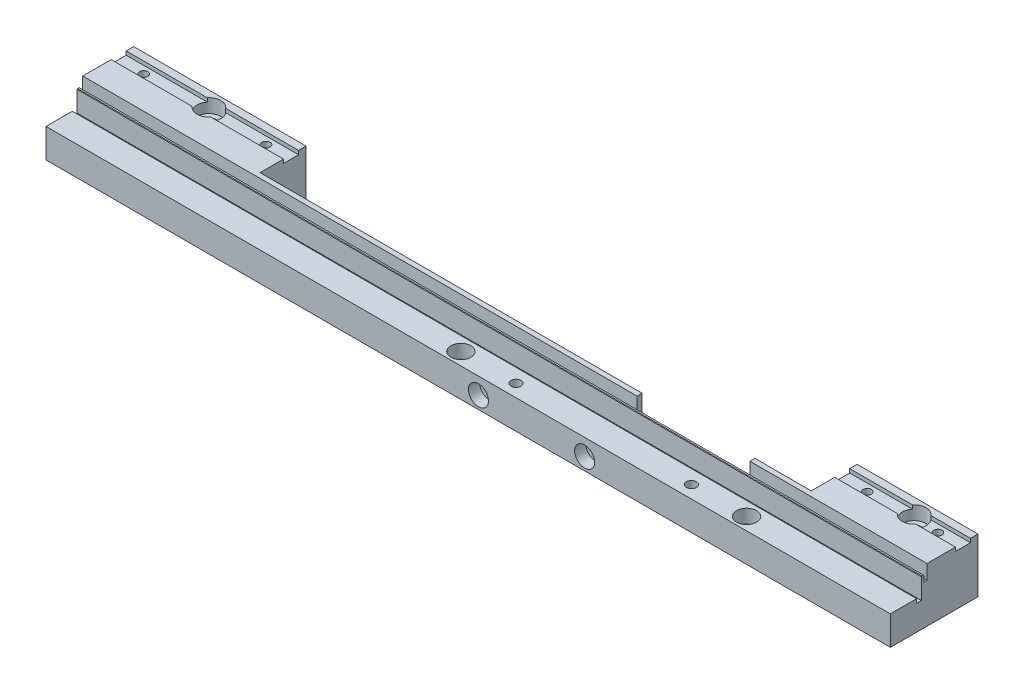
ISO-10303-21;
HEADER;
FILE_DESCRIPTION(('STEP AP214'),'2;1');
FILE_NAME('part.step','',(''),(''),'','','');
FILE_SCHEMA(('AUTOMOTIVE_DESIGN { 1 0 10303 214 1 1 1 1 }'));
ENDSEC;
DATA;
#1=APPLICATION_CONTEXT('core data for automotive mechanical design processes');
#2=APPLICATION_PROTOCOL_DEFINITION('international standard','automotive_design',2000,#1);
#3=PRODUCT_CONTEXT('',#1,'mechanical');
#4=PRODUCT('Part','Part','',(#3));
#5=PRODUCT_RELATED_PRODUCT_CATEGORY('part','',(#4));
#6=PRODUCT_DEFINITION_FORMATION('','',#4);
#7=PRODUCT_DEFINITION_CONTEXT('part definition',#1,'design');
#8=PRODUCT_DEFINITION('design','',#6,#7);
#9=PRODUCT_DEFINITION_SHAPE('','',#8);
#10=(LENGTH_UNIT() NAMED_UNIT(*) SI_UNIT(.MILLI.,.METRE.));
#11=(NAMED_UNIT(*) PLANE_ANGLE_UNIT() SI_UNIT($,.RADIAN.));
#12=(NAMED_UNIT(*) SI_UNIT($,.STERADIAN.) SOLID_ANGLE_UNIT());
#13=UNCERTAINTY_MEASURE_WITH_UNIT(LENGTH_MEASURE(1.E-05),#10,'distance_accuracy_value','');
#14=(GEOMETRIC_REPRESENTATION_CONTEXT(3) GLOBAL_UNCERTAINTY_ASSIGNED_CONTEXT((#13)) GLOBAL_UNIT_ASSIGNED_CONTEXT((#10,
#11,#12)) REPRESENTATION_CONTEXT('',''));
#15=CARTESIAN_POINT('',(0.,0.,0.));
#16=DIRECTION('',(0.,0.,1.));
#17=DIRECTION('',(1.,0.,0.));
#18=AXIS2_PLACEMENT_3D('',#15,#16,#17);
#19=CARTESIAN_POINT('',(172.599999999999,4.99999999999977,0.));
#20=DIRECTION('',(0.,0.,1.));
#21=DIRECTION('',(1.,0.,0.));
#22=AXIS2_PLACEMENT_3D('',#19,#20,#21);
#23=CYLINDRICAL_SURFACE('',#22,2.25);
#24=CARTESIAN_POINT('',(172.599999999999,4.99999999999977,18.3599999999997));
#25=DIRECTION('',(0.,0.,-1.));
#26=DIRECTION('',(-1.,0.,0.));
#27=AXIS2_PLACEMENT_3D('',#24,#25,#26);
#28=CIRCLE('',#27,2.25);
#29=CARTESIAN_POINT('',(170.349999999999,4.99999999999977,18.3599999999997));
#30=VERTEX_POINT('',#29);
#31=EDGE_CURVE('E861',#30,#30,#28,.T.);
#32=ORIENTED_EDGE('',*,*,#31,.T.);
#33=EDGE_LOOP('',(#32));
#34=FACE_BOUND('',#33,.T.);
#35=CARTESIAN_POINT('',(172.599999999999,4.99999999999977,30.5));
#36=DIRECTION('',(0.,0.,1.));
#37=DIRECTION('',(1.,0.,0.));
#38=AXIS2_PLACEMENT_3D('',#35,#36,#37);
#39=CIRCLE('',#38,2.25);
#40=CARTESIAN_POINT('',(174.849999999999,4.99999999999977,30.5));
#41=VERTEX_POINT('',#40);
#42=EDGE_CURVE('E38',#41,#41,#39,.F.);
#43=ORIENTED_EDGE('',*,*,#42,.F.);
#44=EDGE_LOOP('',(#43));
#45=FACE_BOUND('',#44,.T.);
#46=ADVANCED_FACE('F34',(#34,#45),#23,.F.);
#47=CARTESIAN_POINT('',(214.999999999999,4.99999999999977,0.));
#48=DIRECTION('',(0.,0.,1.));
#49=DIRECTION('',(1.,0.,0.));
#50=AXIS2_PLACEMENT_3D('',#47,#48,#49);
#51=CYLINDRICAL_SURFACE('',#50,2.25);
#52=CARTESIAN_POINT('',(214.999999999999,4.99999999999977,18.3599999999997));
#53=DIRECTION('',(0.,0.,-1.));
#54=DIRECTION('',(-1.,0.,0.));
#55=AXIS2_PLACEMENT_3D('',#52,#53,#54);
#56=CIRCLE('',#55,2.25);
#57=CARTESIAN_POINT('',(212.749999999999,4.99999999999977,18.3599999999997));
#58=VERTEX_POINT('',#57);
#59=EDGE_CURVE('E553',#58,#58,#56,.T.);
#60=ORIENTED_EDGE('',*,*,#59,.T.);
#61=EDGE_LOOP('',(#60));
#62=FACE_BOUND('',#61,.T.);
#63=CARTESIAN_POINT('',(214.999999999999,4.99999999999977,30.5));
#64=DIRECTION('',(0.,0.,1.));
#65=DIRECTION('',(1.,0.,0.));
#66=AXIS2_PLACEMENT_3D('',#63,#64,#65);
#67=CIRCLE('',#66,2.25);
#68=CARTESIAN_POINT('',(217.249999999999,4.99999999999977,30.5));
#69=VERTEX_POINT('',#68);
#70=EDGE_CURVE('E562',#69,#69,#67,.F.);
#71=ORIENTED_EDGE('',*,*,#70,.F.);
#72=EDGE_LOOP('',(#71));
#73=FACE_BOUND('',#72,.T.);
#74=ADVANCED_FACE('F576',(#62,#73),#51,.F.);
#75=CARTESIAN_POINT('',(274.599999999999,-13.3000000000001,30.));
#76=DIRECTION('',(0.,1.,0.));
#77=DIRECTION('',(0.,0.,1.));
#78=AXIS2_PLACEMENT_3D('',#75,#76,#77);
#79=CYLINDRICAL_SURFACE('',#78,2.24999999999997);
#80=CARTESIAN_POINT('',(274.599999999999,0.,30.));
#81=DIRECTION('',(0.,1.,0.));
#82=DIRECTION('',(-1.,0.,0.));
#83=AXIS2_PLACEMENT_3D('',#80,#81,#82);
#84=CIRCLE('',#83,2.24999999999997);
#85=CARTESIAN_POINT('',(272.349999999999,0.,30.));
#86=VERTEX_POINT('',#85);
#87=EDGE_CURVE('E437',#86,#86,#84,.T.);
#88=ORIENTED_EDGE('',*,*,#87,.F.);
#89=EDGE_LOOP('',(#88));
#90=FACE_BOUND('',#89,.T.);
#91=CARTESIAN_POINT('',(274.599999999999,6.09999999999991,30.));
#92=DIRECTION('',(0.,1.,0.));
#93=DIRECTION('',(0.,0.,1.));
#94=AXIS2_PLACEMENT_3D('',#91,#92,#93);
#95=CIRCLE('',#94,2.24999999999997);
#96=CARTESIAN_POINT('',(274.599999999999,6.09999999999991,32.25));
#97=VERTEX_POINT('',#96);
#98=EDGE_CURVE('E546',#97,#97,#95,.F.);
#99=ORIENTED_EDGE('',*,*,#98,.F.);
#100=EDGE_LOOP('',(#99));
#101=FACE_BOUND('',#100,.T.);
#102=ADVANCED_FACE('F582',(#90,#101),#79,.F.);
#103=CARTESIAN_POINT('',(160.6,-13.3000000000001,30.));
#104=DIRECTION('',(0.,1.,0.));
#105=DIRECTION('',(0.,0.,1.));
#106=AXIS2_PLACEMENT_3D('',#103,#104,#105);
#107=CYLINDRICAL_SURFACE('',#106,2.25);
#108=CARTESIAN_POINT('',(160.6,0.,30.));
#109=DIRECTION('',(0.,1.,0.));
#110=DIRECTION('',(-1.,0.,0.));
#111=AXIS2_PLACEMENT_3D('',#108,#109,#110);
#112=CIRCLE('',#111,2.25);
#113=CARTESIAN_POINT('',(158.35,0.,30.));
#114=VERTEX_POINT('',#113);
#115=EDGE_CURVE('E434',#114,#114,#112,.T.);
#116=ORIENTED_EDGE('',*,*,#115,.F.);
#117=EDGE_LOOP('',(#116));
#118=FACE_BOUND('',#117,.T.);
#119=CARTESIAN_POINT('',(160.6,6.09999999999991,30.));
#120=DIRECTION('',(0.,1.,0.));
#121=DIRECTION('',(0.,0.,1.));
#122=AXIS2_PLACEMENT_3D('',#119,#120,#121);
#123=CIRCLE('',#122,2.25);
#124=CARTESIAN_POINT('',(160.6,6.09999999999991,32.25));
#125=VERTEX_POINT('',#124);
#126=EDGE_CURVE('E296',#125,#125,#123,.F.);
#127=ORIENTED_EDGE('',*,*,#126,.F.);
#128=EDGE_LOOP('',(#127));
#129=FACE_BOUND('',#128,.T.);
#130=ADVANCED_FACE('F673',(#118,#129),#107,.F.);
#131=CARTESIAN_POINT('',(0.,20.1999999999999,9.00000000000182));
#132=DIRECTION('',(0.,0.,-1.));
#133=DIRECTION('',(-1.,0.,0.));
#134=AXIS2_PLACEMENT_3D('',#131,#132,#133);
#135=PLANE('',#134);
#136=DIRECTION('',(0.,1.,0.));
#137=VECTOR('',#136,1.);
#138=CARTESIAN_POINT('',(313.817270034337,16.1999999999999,9.00000000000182));
#139=LINE('',#138,#137);
#140=CARTESIAN_POINT('',(313.817270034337,20.1999999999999,9.00000000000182));
#141=VERTEX_POINT('',#140);
#142=CARTESIAN_POINT('',(313.817270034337,21.6999999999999,9.00000000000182));
#143=VERTEX_POINT('',#142);
#144=EDGE_CURVE('E291',#141,#143,#139,.T.);
#145=ORIENTED_EDGE('',*,*,#144,.F.);
#146=DIRECTION('',(1.,0.,0.));
#147=VECTOR('',#146,1.);
#148=CARTESIAN_POINT('',(0.,20.1999999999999,9.00000000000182));
#149=LINE('',#148,#147);
#150=CARTESIAN_POINT('',(288.799999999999,20.1999999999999,9.00000000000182));
#151=VERTEX_POINT('',#150);
#152=EDGE_CURVE('E320',#151,#141,#149,.T.);
#153=ORIENTED_EDGE('',*,*,#152,.F.);
#154=DIRECTION('',(0.,1.,0.));
#155=VECTOR('',#154,1.);
#156=CARTESIAN_POINT('',(288.799999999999,20.1999999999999,9.00000000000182));
#157=LINE('',#156,#155);
#158=CARTESIAN_POINT('',(288.799999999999,21.6999999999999,9.00000000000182));
#159=VERTEX_POINT('',#158);
#160=EDGE_CURVE('E483',#151,#159,#157,.T.);
#161=ORIENTED_EDGE('',*,*,#160,.T.);
#162=DIRECTION('',(1.,0.,0.));
#163=VECTOR('',#162,1.);
#164=CARTESIAN_POINT('',(0.,21.6999999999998,9.00000000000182));
#165=LINE('',#164,#163);
#166=EDGE_CURVE('E312',#159,#143,#165,.T.);
#167=ORIENTED_EDGE('',*,*,#166,.T.);
#168=EDGE_LOOP('',(#145,#153,#161,#167));
#169=FACE_BOUND('',#168,.T.);
#170=ADVANCED_FACE('F677',(#169),#135,.T.);
#171=CARTESIAN_POINT('',(0.,20.1999999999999,9.00000000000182));
#172=DIRECTION('',(0.,1.,0.));
#173=DIRECTION('',(0.,0.,1.));
#174=AXIS2_PLACEMENT_3D('',#171,#172,#173);
#175=PLANE('',#174);
#176=CARTESIAN_POINT('',(317.5,20.1999999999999,6.));
#177=DIRECTION('',(0.,1.,0.));
#178=DIRECTION('',(0.,0.,1.));
#179=AXIS2_PLACEMENT_3D('',#176,#177,#178);
#180=CIRCLE('',#179,4.74999999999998);
#181=CARTESIAN_POINT('',(321.182729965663,20.1999999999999,9.00000000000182));
#182=VERTEX_POINT('',#181);
#183=CARTESIAN_POINT('',(321.182729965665,20.1999999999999,3.00000000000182));
#184=VERTEX_POINT('',#183);
#185=EDGE_CURVE('E305',#182,#184,#180,.T.);
#186=ORIENTED_EDGE('',*,*,#185,.F.);
#187=CARTESIAN_POINT('',(337.,20.1999999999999,9.00000000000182));
#188=VERTEX_POINT('',#187);
#189=EDGE_CURVE('E304',#182,#188,#149,.T.);
#190=ORIENTED_EDGE('',*,*,#189,.T.);
#191=DIRECTION('',(0.,0.,1.));
#192=VECTOR('',#191,1.);
#193=CARTESIAN_POINT('',(337.,20.1999999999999,9.00000000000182));
#194=LINE('',#193,#192);
#195=CARTESIAN_POINT('',(337.,20.1999999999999,3.00000000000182));
#196=VERTEX_POINT('',#195);
#197=EDGE_CURVE('E388',#196,#188,#194,.T.);
#198=ORIENTED_EDGE('',*,*,#197,.F.);
#199=DIRECTION('',(1.,0.,0.));
#200=VECTOR('',#199,1.);
#201=CARTESIAN_POINT('',(0.,20.1999999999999,3.00000000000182));
#202=LINE('',#201,#200);
#203=EDGE_CURVE('E1319',#184,#196,#202,.T.);
#204=ORIENTED_EDGE('',*,*,#203,.F.);
#205=EDGE_LOOP('',(#186,#190,#198,#204));
#206=FACE_BOUND('',#205,.T.);
#207=CARTESIAN_POINT('',(327.,20.1999999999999,6.));
#208=DIRECTION('',(0.,1.,0.));
#209=DIRECTION('',(0.,0.,1.));
#210=AXIS2_PLACEMENT_3D('',#207,#208,#209);
#211=CIRCLE('',#210,1.64999999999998);
#212=CARTESIAN_POINT('',(327.,20.1999999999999,7.64999999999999));
#213=VERTEX_POINT('',#212);
#214=EDGE_CURVE('E458',#213,#213,#211,.T.);
#215=ORIENTED_EDGE('',*,*,#214,.F.);
#216=EDGE_LOOP('',(#215));
#217=FACE_BOUND('',#216,.T.);
#218=ADVANCED_FACE('F732',(#206,#217),#175,.T.);
#219=CARTESIAN_POINT('',(0.,20.1999999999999,3.00000000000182));
#220=DIRECTION('',(0.,0.,1.));
#221=DIRECTION('',(1.,0.,0.));
#222=AXIS2_PLACEMENT_3D('',#219,#220,#221);
#223=PLANE('',#222);
#224=DIRECTION('',(0.,1.,0.));
#225=VECTOR('',#224,1.);
#226=CARTESIAN_POINT('',(321.182729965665,16.1999999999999,3.00000000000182));
#227=LINE('',#226,#225);
#228=CARTESIAN_POINT('',(321.182729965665,21.6999999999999,3.00000000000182));
#229=VERTEX_POINT('',#228);
#230=EDGE_CURVE('E12',#184,#229,#227,.T.);
#231=ORIENTED_EDGE('',*,*,#230,.F.);
#232=ORIENTED_EDGE('',*,*,#203,.T.);
#233=DIRECTION('',(0.,-1.,0.));
#234=VECTOR('',#233,1.);
#235=CARTESIAN_POINT('',(337.,20.1999999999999,3.00000000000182));
#236=LINE('',#235,#234);
#237=CARTESIAN_POINT('',(337.,21.6999999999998,3.00000000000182));
#238=VERTEX_POINT('',#237);
#239=EDGE_CURVE('E391',#238,#196,#236,.T.);
#240=ORIENTED_EDGE('',*,*,#239,.F.);
#241=DIRECTION('',(1.,0.,0.));
#242=VECTOR('',#241,1.);
#243=CARTESIAN_POINT('',(0.,21.6999999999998,3.00000000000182));
#244=LINE('',#243,#242);
#245=EDGE_CURVE('E397',#229,#238,#244,.T.);
#246=ORIENTED_EDGE('',*,*,#245,.F.);
#247=EDGE_LOOP('',(#231,#232,#240,#246));
#248=FACE_BOUND('',#247,.T.);
#249=ADVANCED_FACE('F669',(#248),#223,.T.);
#250=CARTESIAN_POINT('',(317.5,-13.3000000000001,6.));
#251=DIRECTION('',(0.,1.,0.));
#252=DIRECTION('',(0.,0.,1.));
#253=AXIS2_PLACEMENT_3D('',#250,#251,#252);
#254=CYLINDRICAL_SURFACE('',#253,2.74999999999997);
#255=CARTESIAN_POINT('',(317.5,0.,6.));
#256=DIRECTION('',(0.,1.,0.));
#257=DIRECTION('',(-1.,0.,0.));
#258=AXIS2_PLACEMENT_3D('',#255,#256,#257);
#259=CIRCLE('',#258,2.74999999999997);
#260=CARTESIAN_POINT('',(314.75,0.,6.));
#261=VERTEX_POINT('',#260);
#262=EDGE_CURVE('E440',#261,#261,#259,.T.);
#263=ORIENTED_EDGE('',*,*,#262,.F.);
#264=EDGE_LOOP('',(#263));
#265=FACE_BOUND('',#264,.T.);
#266=CARTESIAN_POINT('',(317.5,16.1999999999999,6.));
#267=DIRECTION('',(0.,1.,0.));
#268=DIRECTION('',(0.,0.,1.));
#269=AXIS2_PLACEMENT_3D('',#266,#267,#268);
#270=CIRCLE('',#269,2.74999999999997);
#271=CARTESIAN_POINT('',(317.5,16.1999999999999,8.74999999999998));
#272=VERTEX_POINT('',#271);
#273=EDGE_CURVE('E537',#272,#272,#270,.F.);
#274=ORIENTED_EDGE('',*,*,#273,.F.);
#275=EDGE_LOOP('',(#274));
#276=FACE_BOUND('',#275,.T.);
#277=ADVANCED_FACE('F665',(#265,#276),#254,.F.);
#278=DIRECTION('',(0.,1.,0.));
#279=VECTOR('',#278,1.);
#280=CARTESIAN_POINT('',(39.7327299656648,16.1999999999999,3.00000000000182));
#281=LINE('',#280,#279);
#282=CARTESIAN_POINT('',(39.7327299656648,20.1999999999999,3.00000000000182));
#283=VERTEX_POINT('',#282);
#284=CARTESIAN_POINT('',(39.7327299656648,21.6999999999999,3.00000000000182));
#285=VERTEX_POINT('',#284);
#286=EDGE_CURVE('E525',#283,#285,#281,.T.);
#287=ORIENTED_EDGE('',*,*,#286,.F.);
#288=CARTESIAN_POINT('',(68.7999999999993,20.1999999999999,3.00000000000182));
#289=VERTEX_POINT('',#288);
#290=EDGE_CURVE('E1325',#283,#289,#202,.T.);
#291=ORIENTED_EDGE('',*,*,#290,.T.);
#292=DIRECTION('',(0.,1.,0.));
#293=VECTOR('',#292,1.);
#294=CARTESIAN_POINT('',(68.7999999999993,20.1999999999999,3.00000000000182));
#295=LINE('',#294,#293);
#296=CARTESIAN_POINT('',(68.7999999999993,21.6999999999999,3.00000000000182));
#297=VERTEX_POINT('',#296);
#298=EDGE_CURVE('E475',#289,#297,#295,.T.);
#299=ORIENTED_EDGE('',*,*,#298,.T.);
#300=EDGE_CURVE('E1320',#285,#297,#244,.T.);
#301=ORIENTED_EDGE('',*,*,#300,.F.);
#302=EDGE_LOOP('',(#287,#291,#299,#301));
#303=FACE_BOUND('',#302,.T.);
#304=ADVANCED_FACE('F668',(#303),#223,.T.);
#305=CARTESIAN_POINT('',(36.0499999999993,20.1999999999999,6.));
#306=DIRECTION('',(0.,1.,0.));
#307=DIRECTION('',(0.,0.,1.));
#308=AXIS2_PLACEMENT_3D('',#305,#306,#307);
#309=CIRCLE('',#308,4.75);
#310=CARTESIAN_POINT('',(39.7327299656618,20.1999999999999,9.00000000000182));
#311=VERTEX_POINT('',#310);
#312=EDGE_CURVE('E527',#311,#283,#309,.T.);
#313=ORIENTED_EDGE('',*,*,#312,.F.);
#314=CARTESIAN_POINT('',(68.7999999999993,20.1999999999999,9.00000000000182));
#315=VERTEX_POINT('',#314);
#316=EDGE_CURVE('E318',#311,#315,#149,.T.);
#317=ORIENTED_EDGE('',*,*,#316,.T.);
#318=DIRECTION('',(0.,0.,-1.));
#319=VECTOR('',#318,1.);
#320=CARTESIAN_POINT('',(68.7999999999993,20.1999999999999,9.00000000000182));
#321=LINE('',#320,#319);
#322=EDGE_CURVE('E478',#315,#289,#321,.T.);
#323=ORIENTED_EDGE('',*,*,#322,.T.);
#324=ORIENTED_EDGE('',*,*,#290,.F.);
#325=EDGE_LOOP('',(#313,#317,#323,#324));
#326=FACE_BOUND('',#325,.T.);
#327=CARTESIAN_POINT('',(58.7999999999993,20.1999999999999,6.));
#328=DIRECTION('',(0.,1.,0.));
#329=DIRECTION('',(0.,0.,1.));
#330=AXIS2_PLACEMENT_3D('',#327,#328,#329);
#331=CIRCLE('',#330,1.65);
#332=CARTESIAN_POINT('',(58.7999999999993,20.1999999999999,7.65));
#333=VERTEX_POINT('',#332);
#334=EDGE_CURVE('E446',#333,#333,#331,.T.);
#335=ORIENTED_EDGE('',*,*,#334,.F.);
#336=EDGE_LOOP('',(#335));
#337=FACE_BOUND('',#336,.T.);
#338=ADVANCED_FACE('F978',(#326,#337),#175,.T.);
#339=DIRECTION('',(0.,1.,0.));
#340=VECTOR('',#339,1.);
#341=CARTESIAN_POINT('',(32.3672700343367,16.1999999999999,9.00000000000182));
#342=LINE('',#341,#340);
#343=CARTESIAN_POINT('',(32.3672700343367,20.1999999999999,9.00000000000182));
#344=VERTEX_POINT('',#343);
#345=CARTESIAN_POINT('',(32.3672700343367,21.6999999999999,9.00000000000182));
#346=VERTEX_POINT('',#345);
#347=EDGE_CURVE('E850',#344,#346,#342,.T.);
#348=ORIENTED_EDGE('',*,*,#347,.F.);
#349=CARTESIAN_POINT('',(0.,20.1999999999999,9.00000000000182));
#350=VERTEX_POINT('',#349);
#351=EDGE_CURVE('E313',#350,#344,#149,.T.);
#352=ORIENTED_EDGE('',*,*,#351,.F.);
#353=DIRECTION('',(0.,1.,0.));
#354=VECTOR('',#353,1.);
#355=CARTESIAN_POINT('',(0.,20.1999999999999,9.00000000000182));
#356=LINE('',#355,#354);
#357=CARTESIAN_POINT('',(0.,21.6999999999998,9.00000000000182));
#358=VERTEX_POINT('',#357);
#359=EDGE_CURVE('E425',#350,#358,#356,.T.);
#360=ORIENTED_EDGE('',*,*,#359,.T.);
#361=EDGE_CURVE('E316',#358,#346,#165,.T.);
#362=ORIENTED_EDGE('',*,*,#361,.T.);
#363=EDGE_LOOP('',(#348,#352,#360,#362));
#364=FACE_BOUND('',#363,.T.);
#365=ADVANCED_FACE('F682',(#364),#135,.T.);
#366=CARTESIAN_POINT('',(36.0499999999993,-13.3000000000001,6.));
#367=DIRECTION('',(0.,1.,0.));
#368=DIRECTION('',(0.,0.,1.));
#369=AXIS2_PLACEMENT_3D('',#366,#367,#368);
#370=CYLINDRICAL_SURFACE('',#369,2.75);
#371=CARTESIAN_POINT('',(36.0499999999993,1.02348685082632E-13,6.));
#372=DIRECTION('',(0.,1.,0.));
#373=DIRECTION('',(-1.,0.,0.));
#374=AXIS2_PLACEMENT_3D('',#371,#372,#373);
#375=CIRCLE('',#374,2.75);
#376=CARTESIAN_POINT('',(33.2999999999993,1.03276396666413E-13,6.));
#377=VERTEX_POINT('',#376);
#378=EDGE_CURVE('E394',#377,#377,#375,.T.);
#379=ORIENTED_EDGE('',*,*,#378,.F.);
#380=EDGE_LOOP('',(#379));
#381=FACE_BOUND('',#380,.T.);
#382=CARTESIAN_POINT('',(36.0499999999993,16.1999999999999,6.));
#383=DIRECTION('',(0.,1.,0.));
#384=DIRECTION('',(0.,0.,1.));
#385=AXIS2_PLACEMENT_3D('',#382,#383,#384);
#386=CIRCLE('',#385,2.75);
#387=CARTESIAN_POINT('',(36.0499999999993,16.1999999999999,8.75));
#388=VERTEX_POINT('',#387);
#389=EDGE_CURVE('E529',#388,#388,#386,.F.);
#390=ORIENTED_EDGE('',*,*,#389,.F.);
#391=EDGE_LOOP('',(#390));
#392=FACE_BOUND('',#391,.T.);
#393=ADVANCED_FACE('F679',(#381,#392),#370,.F.);
#394=CARTESIAN_POINT('',(266.299999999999,21.6999999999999,35.));
#395=DIRECTION('',(0.,-1.,0.));
#396=DIRECTION('',(0.,0.,-1.));
#397=AXIS2_PLACEMENT_3D('',#394,#395,#396);
#398=PLANE('',#397);
#399=CARTESIAN_POINT('',(321.182729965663,21.6999999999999,9.00000000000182));
#400=VERTEX_POINT('',#399);
#401=CARTESIAN_POINT('',(337.,21.6999999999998,9.00000000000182));
#402=VERTEX_POINT('',#401);
#403=EDGE_CURVE('E302',#400,#402,#165,.T.);
#404=ORIENTED_EDGE('',*,*,#403,.F.);
#405=CARTESIAN_POINT('',(317.5,21.6999999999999,6.));
#406=DIRECTION('',(0.,1.,0.));
#407=DIRECTION('',(0.,0.,1.));
#408=AXIS2_PLACEMENT_3D('',#405,#406,#407);
#409=CIRCLE('',#408,4.74999999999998);
#410=EDGE_CURVE('E284',#143,#400,#409,.T.);
#411=ORIENTED_EDGE('',*,*,#410,.F.);
#412=ORIENTED_EDGE('',*,*,#166,.F.);
#413=DIRECTION('',(0.,0.,1.));
#414=VECTOR('',#413,1.);
#415=CARTESIAN_POINT('',(288.799999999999,21.6999999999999,18.3599999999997));
#416=LINE('',#415,#414);
#417=CARTESIAN_POINT('',(288.799999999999,21.6999999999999,18.3599999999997));
#418=VERTEX_POINT('',#417);
#419=EDGE_CURVE('E521',#159,#418,#416,.T.);
#420=ORIENTED_EDGE('',*,*,#419,.T.);
#421=DIRECTION('',(-1.,0.,0.));
#422=VECTOR('',#421,1.);
#423=CARTESIAN_POINT('',(266.299999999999,21.6999999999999,18.3599999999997));
#424=LINE('',#423,#422);
#425=CARTESIAN_POINT('',(266.299999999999,21.6999999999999,18.3599999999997));
#426=VERTEX_POINT('',#425);
#427=EDGE_CURVE('E515',#418,#426,#424,.T.);
#428=ORIENTED_EDGE('',*,*,#427,.T.);
#429=DIRECTION('',(0.,0.,-1.));
#430=VECTOR('',#429,1.);
#431=CARTESIAN_POINT('',(266.299999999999,21.6999999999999,35.));
#432=LINE('',#431,#430);
#433=CARTESIAN_POINT('',(266.299999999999,21.6999999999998,20.3600000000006));
#434=VERTEX_POINT('',#433);
#435=EDGE_CURVE('E817',#434,#426,#432,.T.);
#436=ORIENTED_EDGE('',*,*,#435,.F.);
#437=DIRECTION('',(1.,0.,0.));
#438=VECTOR('',#437,1.);
#439=CARTESIAN_POINT('',(0.,21.6999999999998,20.3600000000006));
#440=LINE('',#439,#438);
#441=CARTESIAN_POINT('',(337.,21.6999999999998,20.3600000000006));
#442=VERTEX_POINT('',#441);
#443=EDGE_CURVE('E323',#434,#442,#440,.T.);
#444=ORIENTED_EDGE('',*,*,#443,.T.);
#445=DIRECTION('',(0.,0.,-1.));
#446=VECTOR('',#445,1.);
#447=CARTESIAN_POINT('',(337.,21.6999999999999,35.));
#448=LINE('',#447,#446);
#449=EDGE_CURVE('E311',#442,#402,#448,.T.);
#450=ORIENTED_EDGE('',*,*,#449,.T.);
#451=EDGE_LOOP('',(#404,#411,#412,#420,#428,#436,#444,#450));
#452=FACE_BOUND('',#451,.T.);
#453=ADVANCED_FACE('F308',(#452),#398,.F.);
#454=CARTESIAN_POINT('',(288.799999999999,21.6999999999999,3.00000000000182));
#455=VERTEX_POINT('',#454);
#456=CARTESIAN_POINT('',(313.817270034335,21.6999999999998,3.00000000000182));
#457=VERTEX_POINT('',#456);
#458=EDGE_CURVE('E1322',#455,#457,#244,.T.);
#459=ORIENTED_EDGE('',*,*,#458,.T.);
#460=EDGE_CURVE('E50',#229,#457,#409,.T.);
#461=ORIENTED_EDGE('',*,*,#460,.F.);
#462=ORIENTED_EDGE('',*,*,#245,.T.);
#463=CARTESIAN_POINT('',(337.,21.6999999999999,0.));
#464=VERTEX_POINT('',#463);
#465=EDGE_CURVE('E820',#238,#464,#448,.T.);
#466=ORIENTED_EDGE('',*,*,#465,.T.);
#467=DIRECTION('',(-1.,0.,0.));
#468=VECTOR('',#467,1.);
#469=CARTESIAN_POINT('',(266.299999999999,21.6999999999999,0.));
#470=LINE('',#469,#468);
#471=CARTESIAN_POINT('',(288.799999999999,21.6999999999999,0.));
#472=VERTEX_POINT('',#471);
#473=EDGE_CURVE('E802',#464,#472,#470,.T.);
#474=ORIENTED_EDGE('',*,*,#473,.T.);
#475=EDGE_CURVE('E518',#472,#455,#416,.T.);
#476=ORIENTED_EDGE('',*,*,#475,.T.);
#477=EDGE_LOOP('',(#459,#461,#462,#466,#474,#476));
#478=FACE_BOUND('',#477,.T.);
#479=ADVANCED_FACE('F765',(#478),#398,.F.);
#480=CARTESIAN_POINT('',(266.299999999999,18.4000000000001,35.));
#481=DIRECTION('',(1.,0.,0.));
#482=DIRECTION('',(0.,0.,-1.));
#483=AXIS2_PLACEMENT_3D('',#480,#481,#482);
#484=PLANE('',#483);
#485=ORIENTED_EDGE('',*,*,#435,.T.);
#486=DIRECTION('',(0.,1.,0.));
#487=VECTOR('',#486,1.);
#488=CARTESIAN_POINT('',(266.299999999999,-13.3000000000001,18.3599999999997));
#489=LINE('',#488,#487);
#490=CARTESIAN_POINT('',(266.299999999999,0.,18.3599999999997));
#491=VERTEX_POINT('',#490);
#492=EDGE_CURVE('E496',#491,#426,#489,.T.);
#493=ORIENTED_EDGE('',*,*,#492,.F.);
#494=DIRECTION('',(0.,0.,1.));
#495=VECTOR('',#494,1.);
#496=CARTESIAN_POINT('',(266.299999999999,0.,35.));
#497=LINE('',#496,#495);
#498=CARTESIAN_POINT('',(266.299999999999,0.,20.3599999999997));
#499=VERTEX_POINT('',#498);
#500=EDGE_CURVE('E469',#491,#499,#497,.T.);
#501=ORIENTED_EDGE('',*,*,#500,.T.);
#502=DIRECTION('',(0.,1.,0.));
#503=VECTOR('',#502,1.);
#504=CARTESIAN_POINT('',(266.299999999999,-13.3000000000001,20.3599999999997));
#505=LINE('',#504,#503);
#506=CARTESIAN_POINT('',(266.299999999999,15.9,20.3599999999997));
#507=VERTEX_POINT('',#506);
#508=EDGE_CURVE('E498',#499,#507,#505,.T.);
#509=ORIENTED_EDGE('',*,*,#508,.T.);
#510=DIRECTION('',(0.,-1.,0.));
#511=VECTOR('',#510,1.);
#512=CARTESIAN_POINT('',(266.299999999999,18.4000000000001,20.3600000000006));
#513=LINE('',#512,#511);
#514=EDGE_CURVE('E1359',#434,#507,#513,.T.);
#515=ORIENTED_EDGE('',*,*,#514,.F.);
#516=EDGE_LOOP('',(#485,#493,#501,#509,#515));
#517=FACE_BOUND('',#516,.T.);
#518=ADVANCED_FACE('F758',(#517),#484,.F.);
#519=CARTESIAN_POINT('',(221.299999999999,18.4000000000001,35.));
#520=DIRECTION('',(-1.,0.,0.));
#521=DIRECTION('',(0.,0.,1.));
#522=AXIS2_PLACEMENT_3D('',#519,#520,#521);
#523=PLANE('',#522);
#524=DIRECTION('',(0.,1.,0.));
#525=VECTOR('',#524,1.);
#526=CARTESIAN_POINT('',(221.299999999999,-13.3000000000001,18.3599999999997));
#527=LINE('',#526,#525);
#528=CARTESIAN_POINT('',(221.299999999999,0.,18.3599999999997));
#529=VERTEX_POINT('',#528);
#530=CARTESIAN_POINT('',(221.299999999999,21.6999999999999,18.3599999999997));
#531=VERTEX_POINT('',#530);
#532=EDGE_CURVE('E504',#529,#531,#527,.T.);
#533=ORIENTED_EDGE('',*,*,#532,.T.);
#534=DIRECTION('',(0.,0.,-1.));
#535=VECTOR('',#534,1.);
#536=CARTESIAN_POINT('',(221.299999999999,21.6999999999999,35.));
#537=LINE('',#536,#535);
#538=CARTESIAN_POINT('',(221.299999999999,21.6999999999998,20.3600000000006));
#539=VERTEX_POINT('',#538);
#540=EDGE_CURVE('E814',#539,#531,#537,.T.);
#541=ORIENTED_EDGE('',*,*,#540,.F.);
#542=DIRECTION('',(0.,1.,0.));
#543=VECTOR('',#542,1.);
#544=CARTESIAN_POINT('',(221.299999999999,18.4000000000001,20.3600000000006));
#545=LINE('',#544,#543);
#546=CARTESIAN_POINT('',(221.299999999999,15.9,20.3599999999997));
#547=VERTEX_POINT('',#546);
#548=EDGE_CURVE('E354',#547,#539,#545,.T.);
#549=ORIENTED_EDGE('',*,*,#548,.F.);
#550=DIRECTION('',(0.,1.,0.));
#551=VECTOR('',#550,1.);
#552=CARTESIAN_POINT('',(221.299999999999,-13.3000000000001,20.3599999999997));
#553=LINE('',#552,#551);
#554=CARTESIAN_POINT('',(221.299999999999,0.,20.3599999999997));
#555=VERTEX_POINT('',#554);
#556=EDGE_CURVE('E501',#555,#547,#553,.T.);
#557=ORIENTED_EDGE('',*,*,#556,.F.);
#558=DIRECTION('',(0.,0.,-1.));
#559=VECTOR('',#558,1.);
#560=CARTESIAN_POINT('',(221.299999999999,0.,35.));
#561=LINE('',#560,#559);
#562=EDGE_CURVE('E467',#555,#529,#561,.T.);
#563=ORIENTED_EDGE('',*,*,#562,.T.);
#564=EDGE_LOOP('',(#533,#541,#549,#557,#563));
#565=FACE_BOUND('',#564,.T.);
#566=ADVANCED_FACE('F754',(#565),#523,.F.);
#567=CARTESIAN_POINT('',(0.,21.6999999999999,35.));
#568=DIRECTION('',(0.,-1.,0.));
#569=DIRECTION('',(0.,0.,-1.));
#570=AXIS2_PLACEMENT_3D('',#567,#568,#569);
#571=PLANE('',#570);
#572=CARTESIAN_POINT('',(39.7327299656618,21.6999999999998,9.00000000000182));
#573=VERTEX_POINT('',#572);
#574=CARTESIAN_POINT('',(68.7999999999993,21.6999999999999,9.00000000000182));
#575=VERTEX_POINT('',#574);
#576=EDGE_CURVE('E315',#573,#575,#165,.T.);
#577=ORIENTED_EDGE('',*,*,#576,.F.);
#578=CARTESIAN_POINT('',(36.0499999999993,21.6999999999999,6.));
#579=DIRECTION('',(0.,1.,0.));
#580=DIRECTION('',(0.,0.,1.));
#581=AXIS2_PLACEMENT_3D('',#578,#579,#580);
#582=CIRCLE('',#581,4.75);
#583=EDGE_CURVE('E58',#346,#573,#582,.T.);
#584=ORIENTED_EDGE('',*,*,#583,.F.);
#585=ORIENTED_EDGE('',*,*,#361,.F.);
#586=DIRECTION('',(0.,0.,-1.));
#587=VECTOR('',#586,1.);
#588=CARTESIAN_POINT('',(0.,21.6999999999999,35.));
#589=LINE('',#588,#587);
#590=CARTESIAN_POINT('',(0.,21.6999999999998,20.3600000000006));
#591=VERTEX_POINT('',#590);
#592=EDGE_CURVE('E813',#591,#358,#589,.T.);
#593=ORIENTED_EDGE('',*,*,#592,.F.);
#594=EDGE_CURVE('E327',#591,#539,#440,.T.);
#595=ORIENTED_EDGE('',*,*,#594,.T.);
#596=ORIENTED_EDGE('',*,*,#540,.T.);
#597=DIRECTION('',(-1.,0.,0.));
#598=VECTOR('',#597,1.);
#599=CARTESIAN_POINT('',(68.7999999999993,21.6999999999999,18.3599999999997));
#600=LINE('',#599,#598);
#601=CARTESIAN_POINT('',(68.7999999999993,21.6999999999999,18.3599999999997));
#602=VERTEX_POINT('',#601);
#603=EDGE_CURVE('E512',#531,#602,#600,.T.);
#604=ORIENTED_EDGE('',*,*,#603,.T.);
#605=DIRECTION('',(0.,0.,-1.));
#606=VECTOR('',#605,1.);
#607=CARTESIAN_POINT('',(68.7999999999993,21.6999999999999,18.3599999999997));
#608=LINE('',#607,#606);
#609=EDGE_CURVE('E494',#602,#575,#608,.T.);
#610=ORIENTED_EDGE('',*,*,#609,.T.);
#611=EDGE_LOOP('',(#577,#584,#585,#593,#595,#596,#604,#610));
#612=FACE_BOUND('',#611,.T.);
#613=ADVANCED_FACE('F750',(#612),#571,.F.);
#614=CARTESIAN_POINT('',(0.,21.6999999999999,3.00000000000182));
#615=VERTEX_POINT('',#614);
#616=CARTESIAN_POINT('',(32.3672700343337,21.6999999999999,3.00000000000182));
#617=VERTEX_POINT('',#616);
#618=EDGE_CURVE('E1317',#615,#617,#244,.T.);
#619=ORIENTED_EDGE('',*,*,#618,.T.);
#620=EDGE_CURVE('E531',#285,#617,#582,.T.);
#621=ORIENTED_EDGE('',*,*,#620,.F.);
#622=ORIENTED_EDGE('',*,*,#300,.T.);
#623=CARTESIAN_POINT('',(68.7999999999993,21.6999999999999,0.));
#624=VERTEX_POINT('',#623);
#625=EDGE_CURVE('E511',#297,#624,#608,.T.);
#626=ORIENTED_EDGE('',*,*,#625,.T.);
#627=DIRECTION('',(-1.,0.,0.));
#628=VECTOR('',#627,1.);
#629=CARTESIAN_POINT('',(0.,21.6999999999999,0.));
#630=LINE('',#629,#628);
#631=CARTESIAN_POINT('',(0.,21.6999999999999,0.));
#632=VERTEX_POINT('',#631);
#633=EDGE_CURVE('E805',#624,#632,#630,.T.);
#634=ORIENTED_EDGE('',*,*,#633,.T.);
#635=EDGE_CURVE('E810',#615,#632,#589,.T.);
#636=ORIENTED_EDGE('',*,*,#635,.F.);
#637=EDGE_LOOP('',(#619,#621,#622,#626,#634,#636));
#638=FACE_BOUND('',#637,.T.);
#639=ADVANCED_FACE('F753',(#638),#571,.F.);
#640=CARTESIAN_POINT('',(0.,1.13686837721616E-13,35.));
#641=DIRECTION('',(0.,1.,0.));
#642=DIRECTION('',(-1.,0.,0.));
#643=AXIS2_PLACEMENT_3D('',#640,#641,#642);
#644=PLANE('',#643);
#645=ORIENTED_EDGE('',*,*,#378,.T.);
#646=EDGE_LOOP('',(#645));
#647=FACE_BOUND('',#646,.T.);
#648=ORIENTED_EDGE('',*,*,#115,.T.);
#649=EDGE_LOOP('',(#648));
#650=FACE_BOUND('',#649,.T.);
#651=ORIENTED_EDGE('',*,*,#87,.T.);
#652=EDGE_LOOP('',(#651));
#653=FACE_BOUND('',#652,.T.);
#654=ORIENTED_EDGE('',*,*,#262,.T.);
#655=EDGE_LOOP('',(#654));
#656=FACE_BOUND('',#655,.T.);
#657=CARTESIAN_POINT('',(58.7999999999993,0.,6.));
#658=DIRECTION('',(0.,1.,0.));
#659=DIRECTION('',(-1.,0.,0.));
#660=AXIS2_PLACEMENT_3D('',#657,#658,#659);
#661=CIRCLE('',#660,1.65);
#662=CARTESIAN_POINT('',(57.1499999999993,0.,6.));
#663=VERTEX_POINT('',#662);
#664=EDGE_CURVE('E443',#663,#663,#661,.T.);
#665=ORIENTED_EDGE('',*,*,#664,.T.);
#666=EDGE_LOOP('',(#665));
#667=FACE_BOUND('',#666,.T.);
#668=CARTESIAN_POINT('',(10.,1.11022302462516E-13,6.));
#669=DIRECTION('',(0.,1.,0.));
#670=DIRECTION('',(-1.,0.,0.));
#671=AXIS2_PLACEMENT_3D('',#668,#669,#670);
#672=CIRCLE('',#671,1.65);
#673=CARTESIAN_POINT('',(8.35,1.11578929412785E-13,6.));
#674=VERTEX_POINT('',#673);
#675=EDGE_CURVE('E447',#674,#674,#672,.T.);
#676=ORIENTED_EDGE('',*,*,#675,.T.);
#677=EDGE_LOOP('',(#676));
#678=FACE_BOUND('',#677,.T.);
#679=CARTESIAN_POINT('',(298.799999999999,0.,6.));
#680=DIRECTION('',(0.,1.,0.));
#681=DIRECTION('',(-1.,0.,0.));
#682=AXIS2_PLACEMENT_3D('',#679,#680,#681);
#683=CIRCLE('',#682,1.64999999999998);
#684=CARTESIAN_POINT('',(297.149999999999,0.,6.));
#685=VERTEX_POINT('',#684);
#686=EDGE_CURVE('E451',#685,#685,#683,.T.);
#687=ORIENTED_EDGE('',*,*,#686,.T.);
#688=EDGE_LOOP('',(#687));
#689=FACE_BOUND('',#688,.T.);
#690=CARTESIAN_POINT('',(327.,0.,6.));
#691=DIRECTION('',(0.,1.,0.));
#692=DIRECTION('',(-1.,0.,0.));
#693=AXIS2_PLACEMENT_3D('',#690,#691,#692);
#694=CIRCLE('',#693,1.64999999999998);
#695=CARTESIAN_POINT('',(325.35,0.,6.));
#696=VERTEX_POINT('',#695);
#697=EDGE_CURVE('E455',#696,#696,#694,.T.);
#698=ORIENTED_EDGE('',*,*,#697,.T.);
#699=EDGE_LOOP('',(#698));
#700=FACE_BOUND('',#699,.T.);
#701=CARTESIAN_POINT('',(182.599999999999,0.,30.));
#702=DIRECTION('',(0.,1.,0.));
#703=DIRECTION('',(-1.,0.,0.));
#704=AXIS2_PLACEMENT_3D('',#701,#702,#703);
#705=CIRCLE('',#704,2.00000000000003);
#706=CARTESIAN_POINT('',(180.599999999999,0.,30.));
#707=VERTEX_POINT('',#706);
#708=EDGE_CURVE('E459',#707,#707,#705,.T.);
#709=ORIENTED_EDGE('',*,*,#708,.T.);
#710=EDGE_LOOP('',(#709));
#711=FACE_BOUND('',#710,.T.);
#712=CARTESIAN_POINT('',(252.6,0.,30.));
#713=DIRECTION('',(0.,1.,0.));
#714=DIRECTION('',(-1.,0.,0.));
#715=AXIS2_PLACEMENT_3D('',#712,#713,#714);
#716=CIRCLE('',#715,2.);
#717=CARTESIAN_POINT('',(250.6,0.,30.));
#718=VERTEX_POINT('',#717);
#719=EDGE_CURVE('E463',#718,#718,#716,.T.);
#720=ORIENTED_EDGE('',*,*,#719,.T.);
#721=EDGE_LOOP('',(#720));
#722=FACE_BOUND('',#721,.T.);
#723=DIRECTION('',(0.,0.,-1.));
#724=VECTOR('',#723,1.);
#725=CARTESIAN_POINT('',(68.7999999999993,0.,35.));
#726=LINE('',#725,#724);
#727=CARTESIAN_POINT('',(68.7999999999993,0.,18.3599999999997));
#728=VERTEX_POINT('',#727);
#729=CARTESIAN_POINT('',(68.7999999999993,0.,0.));
#730=VERTEX_POINT('',#729);
#731=EDGE_CURVE('E473',#728,#730,#726,.T.);
#732=ORIENTED_EDGE('',*,*,#731,.F.);
#733=DIRECTION('',(-1.,0.,0.));
#734=VECTOR('',#733,1.);
#735=CARTESIAN_POINT('',(0.,1.13686837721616E-13,18.3599999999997));
#736=LINE('',#735,#734);
#737=EDGE_CURVE('E844',#529,#728,#736,.T.);
#738=ORIENTED_EDGE('',*,*,#737,.F.);
#739=ORIENTED_EDGE('',*,*,#562,.F.);
#740=DIRECTION('',(-1.,0.,0.));
#741=VECTOR('',#740,1.);
#742=CARTESIAN_POINT('',(0.,1.13686837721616E-13,20.3599999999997));
#743=LINE('',#742,#741);
#744=EDGE_CURVE('E471',#499,#555,#743,.T.);
#745=ORIENTED_EDGE('',*,*,#744,.F.);
#746=ORIENTED_EDGE('',*,*,#500,.F.);
#747=DIRECTION('',(-1.,0.,0.));
#748=VECTOR('',#747,1.);
#749=CARTESIAN_POINT('',(0.,1.13686837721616E-13,18.3599999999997));
#750=LINE('',#749,#748);
#751=CARTESIAN_POINT('',(288.799999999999,0.,18.3599999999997));
#752=VERTEX_POINT('',#751);
#753=EDGE_CURVE('E842',#752,#491,#750,.T.);
#754=ORIENTED_EDGE('',*,*,#753,.F.);
#755=DIRECTION('',(0.,0.,1.));
#756=VECTOR('',#755,1.);
#757=CARTESIAN_POINT('',(288.799999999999,0.,35.));
#758=LINE('',#757,#756);
#759=CARTESIAN_POINT('',(288.799999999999,0.,0.));
#760=VERTEX_POINT('',#759);
#761=EDGE_CURVE('E481',#760,#752,#758,.T.);
#762=ORIENTED_EDGE('',*,*,#761,.F.);
#763=DIRECTION('',(1.,0.,0.));
#764=VECTOR('',#763,1.);
#765=CARTESIAN_POINT('',(0.,1.13686837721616E-13,0.));
#766=LINE('',#765,#764);
#767=CARTESIAN_POINT('',(337.,0.,0.));
#768=VERTEX_POINT('',#767);
#769=EDGE_CURVE('E799',#760,#768,#766,.T.);
#770=ORIENTED_EDGE('',*,*,#769,.T.);
#771=DIRECTION('',(0.,0.,-1.));
#772=VECTOR('',#771,1.);
#773=CARTESIAN_POINT('',(337.,0.,35.));
#774=LINE('',#773,#772);
#775=CARTESIAN_POINT('',(337.,0.,35.));
#776=VERTEX_POINT('',#775);
#777=EDGE_CURVE('E822',#776,#768,#774,.T.);
#778=ORIENTED_EDGE('',*,*,#777,.F.);
#779=DIRECTION('',(1.,0.,0.));
#780=VECTOR('',#779,1.);
#781=CARTESIAN_POINT('',(0.,1.13686837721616E-13,35.));
#782=LINE('',#781,#780);
#783=CARTESIAN_POINT('',(0.,1.13686837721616E-13,35.));
#784=VERTEX_POINT('',#783);
#785=EDGE_CURVE('E785',#784,#776,#782,.T.);
#786=ORIENTED_EDGE('',*,*,#785,.F.);
#787=DIRECTION('',(0.,0.,-1.));
#788=VECTOR('',#787,1.);
#789=CARTESIAN_POINT('',(0.,1.13686837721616E-13,35.));
#790=LINE('',#789,#788);
#791=CARTESIAN_POINT('',(0.,1.13686837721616E-13,0.));
#792=VERTEX_POINT('',#791);
#793=EDGE_CURVE('E789',#784,#792,#790,.T.);
#794=ORIENTED_EDGE('',*,*,#793,.T.);
#795=EDGE_CURVE('E795',#792,#730,#766,.T.);
#796=ORIENTED_EDGE('',*,*,#795,.T.);
#797=EDGE_LOOP('',(#732,#738,#739,#745,#746,#754,#762,#770,#778,#786,#794,#796));
#798=FACE_BOUND('',#797,.T.);
#799=ADVANCED_FACE('F36',(#647,#650,#653,#656,#667,#678,#689,#700,#711,#722,#798),#644,.F.);
#800=CARTESIAN_POINT('',(337.,0.,0.));
#801=DIRECTION('',(0.,0.,1.));
#802=DIRECTION('',(1.,0.,0.));
#803=AXIS2_PLACEMENT_3D('',#800,#801,#802);
#804=PLANE('',#803);
#805=DIRECTION('',(0.,1.,0.));
#806=VECTOR('',#805,1.);
#807=CARTESIAN_POINT('',(68.7999999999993,-13.3000000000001,0.));
#808=LINE('',#807,#806);
#809=EDGE_CURVE('E489',#730,#624,#808,.T.);
#810=ORIENTED_EDGE('',*,*,#809,.F.);
#811=ORIENTED_EDGE('',*,*,#795,.F.);
#812=DIRECTION('',(0.,-1.,0.));
#813=VECTOR('',#812,1.);
#814=CARTESIAN_POINT('',(0.,1.13686837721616E-13,0.));
#815=LINE('',#814,#813);
#816=EDGE_CURVE('E791',#632,#792,#815,.T.);
#817=ORIENTED_EDGE('',*,*,#816,.F.);
#818=ORIENTED_EDGE('',*,*,#633,.F.);
#819=EDGE_LOOP('',(#810,#811,#817,#818));
#820=FACE_BOUND('',#819,.T.);
#821=ADVANCED_FACE('F742',(#820),#804,.F.);
#822=DIRECTION('',(0.,1.,0.));
#823=VECTOR('',#822,1.);
#824=CARTESIAN_POINT('',(288.799999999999,-13.3000000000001,0.));
#825=LINE('',#824,#823);
#826=EDGE_CURVE('E490',#760,#472,#825,.T.);
#827=ORIENTED_EDGE('',*,*,#826,.T.);
#828=ORIENTED_EDGE('',*,*,#473,.F.);
#829=DIRECTION('',(0.,1.,0.));
#830=VECTOR('',#829,1.);
#831=CARTESIAN_POINT('',(337.,0.,0.));
#832=LINE('',#831,#830);
#833=EDGE_CURVE('E798',#768,#464,#832,.T.);
#834=ORIENTED_EDGE('',*,*,#833,.F.);
#835=ORIENTED_EDGE('',*,*,#769,.F.);
#836=EDGE_LOOP('',(#827,#828,#834,#835));
#837=FACE_BOUND('',#836,.T.);
#838=ADVANCED_FACE('F721',(#837),#804,.F.);
#839=CARTESIAN_POINT('',(0.,15.9,20.3600000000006));
#840=DIRECTION('',(0.,0.,1.));
#841=DIRECTION('',(1.,0.,0.));
#842=AXIS2_PLACEMENT_3D('',#839,#840,#841);
#843=PLANE('',#842);
#844=DIRECTION('',(1.,0.,0.));
#845=VECTOR('',#844,1.);
#846=CARTESIAN_POINT('',(0.,15.9,20.3600000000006));
#847=LINE('',#846,#845);
#848=CARTESIAN_POINT('',(0.,15.9,20.3600000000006));
#849=VERTEX_POINT('',#848);
#850=EDGE_CURVE('E332',#849,#547,#847,.T.);
#851=ORIENTED_EDGE('',*,*,#850,.T.);
#852=ORIENTED_EDGE('',*,*,#548,.T.);
#853=ORIENTED_EDGE('',*,*,#594,.F.);
#854=DIRECTION('',(0.,-1.,0.));
#855=VECTOR('',#854,1.);
#856=CARTESIAN_POINT('',(0.,15.9,20.3600000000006));
#857=LINE('',#856,#855);
#858=EDGE_CURVE('E422',#591,#849,#857,.T.);
#859=ORIENTED_EDGE('',*,*,#858,.T.);
#860=EDGE_LOOP('',(#851,#852,#853,#859));
#861=FACE_BOUND('',#860,.T.);
#862=ADVANCED_FACE('F717',(#861),#843,.T.);
#863=ORIENTED_EDGE('',*,*,#514,.T.);
#864=CARTESIAN_POINT('',(337.,15.9,20.3600000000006));
#865=VERTEX_POINT('',#864);
#866=EDGE_CURVE('E330',#507,#865,#847,.T.);
#867=ORIENTED_EDGE('',*,*,#866,.T.);
#868=DIRECTION('',(0.,-1.,0.));
#869=VECTOR('',#868,1.);
#870=CARTESIAN_POINT('',(337.,15.9,20.3600000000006));
#871=LINE('',#870,#869);
#872=EDGE_CURVE('E383',#442,#865,#871,.T.);
#873=ORIENTED_EDGE('',*,*,#872,.F.);
#874=ORIENTED_EDGE('',*,*,#443,.F.);
#875=EDGE_LOOP('',(#863,#867,#873,#874));
#876=FACE_BOUND('',#875,.T.);
#877=ADVANCED_FACE('F720',(#876),#843,.T.);
#878=DIRECTION('',(0.,1.,0.));
#879=VECTOR('',#878,1.);
#880=CARTESIAN_POINT('',(32.3672700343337,16.1999999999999,3.00000000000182));
#881=LINE('',#880,#879);
#882=CARTESIAN_POINT('',(32.3672700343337,20.1999999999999,3.00000000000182));
#883=VERTEX_POINT('',#882);
#884=EDGE_CURVE('E522',#617,#883,#881,.F.);
#885=ORIENTED_EDGE('',*,*,#884,.F.);
#886=ORIENTED_EDGE('',*,*,#618,.F.);
#887=DIRECTION('',(0.,-1.,0.));
#888=VECTOR('',#887,1.);
#889=CARTESIAN_POINT('',(0.,20.1999999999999,3.00000000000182));
#890=LINE('',#889,#888);
#891=CARTESIAN_POINT('',(0.,20.1999999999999,3.00000000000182));
#892=VERTEX_POINT('',#891);
#893=EDGE_CURVE('E358',#615,#892,#890,.T.);
#894=ORIENTED_EDGE('',*,*,#893,.T.);
#895=EDGE_CURVE('E1316',#892,#883,#202,.T.);
#896=ORIENTED_EDGE('',*,*,#895,.T.);
#897=EDGE_LOOP('',(#885,#886,#894,#896));
#898=FACE_BOUND('',#897,.T.);
#899=ADVANCED_FACE('F730',(#898),#223,.T.);
#900=EDGE_CURVE('E524',#883,#344,#309,.T.);
#901=ORIENTED_EDGE('',*,*,#900,.F.);
#902=ORIENTED_EDGE('',*,*,#895,.F.);
#903=DIRECTION('',(0.,0.,1.));
#904=VECTOR('',#903,1.);
#905=CARTESIAN_POINT('',(0.,20.1999999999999,9.00000000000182));
#906=LINE('',#905,#904);
#907=EDGE_CURVE('E427',#892,#350,#906,.T.);
#908=ORIENTED_EDGE('',*,*,#907,.T.);
#909=ORIENTED_EDGE('',*,*,#351,.T.);
#910=EDGE_LOOP('',(#901,#902,#908,#909));
#911=FACE_BOUND('',#910,.T.);
#912=CARTESIAN_POINT('',(10.,20.1999999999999,6.));
#913=DIRECTION('',(0.,1.,0.));
#914=DIRECTION('',(0.,0.,1.));
#915=AXIS2_PLACEMENT_3D('',#912,#913,#914);
#916=CIRCLE('',#915,1.65);
#917=CARTESIAN_POINT('',(10.,20.1999999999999,7.65));
#918=VERTEX_POINT('',#917);
#919=EDGE_CURVE('E450',#918,#918,#916,.T.);
#920=ORIENTED_EDGE('',*,*,#919,.F.);
#921=EDGE_LOOP('',(#920));
#922=FACE_BOUND('',#921,.T.);
#923=ADVANCED_FACE('F726',(#911,#922),#175,.T.);
#924=DIRECTION('',(0.,1.,0.));
#925=VECTOR('',#924,1.);
#926=CARTESIAN_POINT('',(39.7327299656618,16.1999999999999,9.00000000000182));
#927=LINE('',#926,#925);
#928=EDGE_CURVE('E846',#573,#311,#927,.F.);
#929=ORIENTED_EDGE('',*,*,#928,.F.);
#930=ORIENTED_EDGE('',*,*,#576,.T.);
#931=DIRECTION('',(0.,-1.,0.));
#932=VECTOR('',#931,1.);
#933=CARTESIAN_POINT('',(68.7999999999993,20.1999999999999,9.00000000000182));
#934=LINE('',#933,#932);
#935=EDGE_CURVE('E839',#575,#315,#934,.T.);
#936=ORIENTED_EDGE('',*,*,#935,.T.);
#937=ORIENTED_EDGE('',*,*,#316,.F.);
#938=EDGE_LOOP('',(#929,#930,#936,#937));
#939=FACE_BOUND('',#938,.T.);
#940=ADVANCED_FACE('F723',(#939),#135,.T.);
#941=DIRECTION('',(0.,1.,0.));
#942=VECTOR('',#941,1.);
#943=CARTESIAN_POINT('',(321.182729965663,16.1999999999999,9.00000000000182));
#944=LINE('',#943,#942);
#945=EDGE_CURVE('E288',#400,#182,#944,.F.);
#946=ORIENTED_EDGE('',*,*,#945,.F.);
#947=ORIENTED_EDGE('',*,*,#403,.T.);
#948=DIRECTION('',(0.,1.,0.));
#949=VECTOR('',#948,1.);
#950=CARTESIAN_POINT('',(337.,20.1999999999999,9.00000000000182));
#951=LINE('',#950,#949);
#952=EDGE_CURVE('E386',#188,#402,#951,.T.);
#953=ORIENTED_EDGE('',*,*,#952,.F.);
#954=ORIENTED_EDGE('',*,*,#189,.F.);
#955=EDGE_LOOP('',(#946,#947,#953,#954));
#956=FACE_BOUND('',#955,.T.);
#957=ADVANCED_FACE('F300',(#956),#135,.T.);
#958=CARTESIAN_POINT('',(313.817270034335,20.1999999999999,3.00000000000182));
#959=VERTEX_POINT('',#958);
#960=EDGE_CURVE('E536',#959,#141,#180,.T.);
#961=ORIENTED_EDGE('',*,*,#960,.F.);
#962=CARTESIAN_POINT('',(288.799999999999,20.1999999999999,3.00000000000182));
#963=VERTEX_POINT('',#962);
#964=EDGE_CURVE('E1323',#963,#959,#202,.T.);
#965=ORIENTED_EDGE('',*,*,#964,.F.);
#966=DIRECTION('',(0.,0.,1.));
#967=VECTOR('',#966,1.);
#968=CARTESIAN_POINT('',(288.799999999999,20.1999999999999,9.00000000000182));
#969=LINE('',#968,#967);
#970=EDGE_CURVE('E486',#963,#151,#969,.T.);
#971=ORIENTED_EDGE('',*,*,#970,.T.);
#972=ORIENTED_EDGE('',*,*,#152,.T.);
#973=EDGE_LOOP('',(#961,#965,#971,#972));
#974=FACE_BOUND('',#973,.T.);
#975=CARTESIAN_POINT('',(298.799999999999,20.1999999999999,6.));
#976=DIRECTION('',(0.,1.,0.));
#977=DIRECTION('',(0.,0.,1.));
#978=AXIS2_PLACEMENT_3D('',#975,#976,#977);
#979=CIRCLE('',#978,1.64999999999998);
#980=CARTESIAN_POINT('',(298.799999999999,20.1999999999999,7.64999999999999));
#981=VERTEX_POINT('',#980);
#982=EDGE_CURVE('E454',#981,#981,#979,.T.);
#983=ORIENTED_EDGE('',*,*,#982,.F.);
#984=EDGE_LOOP('',(#983));
#985=FACE_BOUND('',#984,.T.);
#986=ADVANCED_FACE('F733',(#974,#985),#175,.T.);
#987=DIRECTION('',(0.,1.,0.));
#988=VECTOR('',#987,1.);
#989=CARTESIAN_POINT('',(313.817270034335,16.1999999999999,3.00000000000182));
#990=LINE('',#989,#988);
#991=EDGE_CURVE('E43',#457,#959,#990,.F.);
#992=ORIENTED_EDGE('',*,*,#991,.F.);
#993=ORIENTED_EDGE('',*,*,#458,.F.);
#994=DIRECTION('',(0.,-1.,0.));
#995=VECTOR('',#994,1.);
#996=CARTESIAN_POINT('',(288.799999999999,20.1999999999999,3.00000000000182));
#997=LINE('',#996,#995);
#998=EDGE_CURVE('E824',#455,#963,#997,.T.);
#999=ORIENTED_EDGE('',*,*,#998,.T.);
#1000=ORIENTED_EDGE('',*,*,#964,.T.);
#1001=EDGE_LOOP('',(#992,#993,#999,#1000));
#1002=FACE_BOUND('',#1001,.T.);
#1003=ADVANCED_FACE('F737',(#1002),#223,.T.);
#1004=CARTESIAN_POINT('',(337.,0.,35.));
#1005=DIRECTION('',(-1.,0.,0.));
#1006=DIRECTION('',(0.,0.,1.));
#1007=AXIS2_PLACEMENT_3D('',#1004,#1005,#1006);
#1008=PLANE('',#1007);
#1009=DIRECTION('',(0.,0.,1.));
#1010=VECTOR('',#1009,1.);
#1011=CARTESIAN_POINT('',(337.,11.5999999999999,35.0000000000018));
#1012=LINE('',#1011,#1010);
#1013=CARTESIAN_POINT('',(337.,11.5999999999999,24.5000000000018));
#1014=VERTEX_POINT('',#1013);
#1015=CARTESIAN_POINT('',(337.,11.5999999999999,35.0000000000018));
#1016=VERTEX_POINT('',#1015);
#1017=EDGE_CURVE('E355',#1014,#1016,#1012,.T.);
#1018=ORIENTED_EDGE('',*,*,#1017,.T.);
#1019=DIRECTION('',(0.,1.,0.));
#1020=VECTOR('',#1019,1.);
#1021=CARTESIAN_POINT('',(337.,0.,35.));
#1022=LINE('',#1021,#1020);
#1023=EDGE_CURVE('E777',#776,#1016,#1022,.T.);
#1024=ORIENTED_EDGE('',*,*,#1023,.F.);
#1025=ORIENTED_EDGE('',*,*,#777,.T.);
#1026=ORIENTED_EDGE('',*,*,#833,.T.);
#1027=ORIENTED_EDGE('',*,*,#465,.F.);
#1028=ORIENTED_EDGE('',*,*,#239,.T.);
#1029=ORIENTED_EDGE('',*,*,#197,.T.);
#1030=ORIENTED_EDGE('',*,*,#952,.T.);
#1031=ORIENTED_EDGE('',*,*,#449,.F.);
#1032=ORIENTED_EDGE('',*,*,#872,.T.);
#1033=DIRECTION('',(0.,0.,1.));
#1034=VECTOR('',#1033,1.);
#1035=CARTESIAN_POINT('',(337.,15.9,21.6000000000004));
#1036=LINE('',#1035,#1034);
#1037=CARTESIAN_POINT('',(337.,15.9,21.6000000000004));
#1038=VERTEX_POINT('',#1037);
#1039=EDGE_CURVE('E380',#865,#1038,#1036,.T.);
#1040=ORIENTED_EDGE('',*,*,#1039,.T.);
#1041=DIRECTION('',(0.,1.,0.));
#1042=VECTOR('',#1041,1.);
#1043=CARTESIAN_POINT('',(337.,15.9,21.6000000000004));
#1044=LINE('',#1043,#1042);
#1045=CARTESIAN_POINT('',(337.,18.1999999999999,21.6000000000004));
#1046=VERTEX_POINT('',#1045);
#1047=EDGE_CURVE('E377',#1038,#1046,#1044,.T.);
#1048=ORIENTED_EDGE('',*,*,#1047,.T.);
#1049=DIRECTION('',(0.,0.707106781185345,0.70710678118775));
#1050=VECTOR('',#1049,1.);
#1051=CARTESIAN_POINT('',(337.,18.4,21.8000000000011));
#1052=LINE('',#1051,#1050);
#1053=CARTESIAN_POINT('',(337.,18.4,21.8000000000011));
#1054=VERTEX_POINT('',#1053);
#1055=EDGE_CURVE('E374',#1046,#1054,#1052,.T.);
#1056=ORIENTED_EDGE('',*,*,#1055,.T.);
#1057=DIRECTION('',(0.,0.,1.));
#1058=VECTOR('',#1057,1.);
#1059=CARTESIAN_POINT('',(337.,18.4,22.4000000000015));
#1060=LINE('',#1059,#1058);
#1061=CARTESIAN_POINT('',(337.,18.4,22.4000000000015));
#1062=VERTEX_POINT('',#1061);
#1063=EDGE_CURVE('E371',#1054,#1062,#1060,.T.);
#1064=ORIENTED_EDGE('',*,*,#1063,.T.);
#1065=DIRECTION('',(0.,-0.707106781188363,0.707106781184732));
#1066=VECTOR('',#1065,1.);
#1067=CARTESIAN_POINT('',(337.,18.4,22.4000000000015));
#1068=LINE('',#1067,#1066);
#1069=CARTESIAN_POINT('',(337.,18.2,22.6000000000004));
#1070=VERTEX_POINT('',#1069);
#1071=EDGE_CURVE('E368',#1062,#1070,#1068,.T.);
#1072=ORIENTED_EDGE('',*,*,#1071,.T.);
#1073=DIRECTION('',(0.,-1.,0.));
#1074=VECTOR('',#1073,1.);
#1075=CARTESIAN_POINT('',(337.,9.99999999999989,22.6000000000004));
#1076=LINE('',#1075,#1074);
#1077=CARTESIAN_POINT('',(337.,9.99999999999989,22.6000000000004));
#1078=VERTEX_POINT('',#1077);
#1079=EDGE_CURVE('E365',#1070,#1078,#1076,.T.);
#1080=ORIENTED_EDGE('',*,*,#1079,.T.);
#1081=DIRECTION('',(0.,0.,1.));
#1082=VECTOR('',#1081,1.);
#1083=CARTESIAN_POINT('',(337.,9.99999999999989,24.5000000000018));
#1084=LINE('',#1083,#1082);
#1085=CARTESIAN_POINT('',(337.,9.99999999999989,24.5000000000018));
#1086=VERTEX_POINT('',#1085);
#1087=EDGE_CURVE('E362',#1078,#1086,#1084,.T.);
#1088=ORIENTED_EDGE('',*,*,#1087,.T.);
#1089=DIRECTION('',(0.,1.,0.));
#1090=VECTOR('',#1089,1.);
#1091=CARTESIAN_POINT('',(337.,9.99999999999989,24.5000000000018));
#1092=LINE('',#1091,#1090);
#1093=EDGE_CURVE('E359',#1086,#1014,#1092,.T.);
#1094=ORIENTED_EDGE('',*,*,#1093,.T.);
#1095=EDGE_LOOP('',(#1018,#1024,#1025,#1026,#1027,#1028,#1029,#1030,#1031,#1032,#1040,#1048,
#1056,#1064,#1072,#1080,#1088,#1094));
#1096=FACE_BOUND('',#1095,.T.);
#1097=ADVANCED_FACE('F748',(#1096),#1008,.F.);
#1098=CARTESIAN_POINT('',(0.,1.13686837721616E-13,35.));
#1099=DIRECTION('',(1.,0.,0.));
#1100=DIRECTION('',(0.,0.,-1.));
#1101=AXIS2_PLACEMENT_3D('',#1098,#1099,#1100);
#1102=PLANE('',#1101);
#1103=DIRECTION('',(0.,0.,1.));
#1104=VECTOR('',#1103,1.);
#1105=CARTESIAN_POINT('',(0.,11.5999999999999,35.0000000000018));
#1106=LINE('',#1105,#1104);
#1107=CARTESIAN_POINT('',(0.,11.5999999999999,24.5000000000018));
#1108=VERTEX_POINT('',#1107);
#1109=CARTESIAN_POINT('',(0.,11.5999999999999,35.));
#1110=VERTEX_POINT('',#1109);
#1111=EDGE_CURVE('E395',#1108,#1110,#1106,.T.);
#1112=ORIENTED_EDGE('',*,*,#1111,.F.);
#1113=DIRECTION('',(0.,1.,0.));
#1114=VECTOR('',#1113,1.);
#1115=CARTESIAN_POINT('',(0.,9.99999999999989,24.5000000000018));
#1116=LINE('',#1115,#1114);
#1117=CARTESIAN_POINT('',(0.,9.99999999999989,24.5000000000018));
#1118=VERTEX_POINT('',#1117);
#1119=EDGE_CURVE('E398',#1118,#1108,#1116,.T.);
#1120=ORIENTED_EDGE('',*,*,#1119,.F.);
#1121=DIRECTION('',(0.,0.,1.));
#1122=VECTOR('',#1121,1.);
#1123=CARTESIAN_POINT('',(0.,9.99999999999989,24.5000000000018));
#1124=LINE('',#1123,#1122);
#1125=CARTESIAN_POINT('',(0.,9.99999999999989,22.6000000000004));
#1126=VERTEX_POINT('',#1125);
#1127=EDGE_CURVE('E401',#1126,#1118,#1124,.T.);
#1128=ORIENTED_EDGE('',*,*,#1127,.F.);
#1129=DIRECTION('',(0.,-1.,0.));
#1130=VECTOR('',#1129,1.);
#1131=CARTESIAN_POINT('',(0.,9.99999999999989,22.6000000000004));
#1132=LINE('',#1131,#1130);
#1133=CARTESIAN_POINT('',(0.,18.2,22.6000000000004));
#1134=VERTEX_POINT('',#1133);
#1135=EDGE_CURVE('E404',#1134,#1126,#1132,.T.);
#1136=ORIENTED_EDGE('',*,*,#1135,.F.);
#1137=DIRECTION('',(0.,-0.707106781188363,0.707106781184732));
#1138=VECTOR('',#1137,1.);
#1139=CARTESIAN_POINT('',(0.,18.4,22.4000000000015));
#1140=LINE('',#1139,#1138);
#1141=CARTESIAN_POINT('',(0.,18.4,22.4000000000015));
#1142=VERTEX_POINT('',#1141);
#1143=EDGE_CURVE('E407',#1142,#1134,#1140,.T.);
#1144=ORIENTED_EDGE('',*,*,#1143,.F.);
#1145=DIRECTION('',(0.,0.,1.));
#1146=VECTOR('',#1145,1.);
#1147=CARTESIAN_POINT('',(0.,18.4,22.4000000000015));
#1148=LINE('',#1147,#1146);
#1149=CARTESIAN_POINT('',(0.,18.4,21.8000000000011));
#1150=VERTEX_POINT('',#1149);
#1151=EDGE_CURVE('E410',#1150,#1142,#1148,.T.);
#1152=ORIENTED_EDGE('',*,*,#1151,.F.);
#1153=DIRECTION('',(0.,0.707106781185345,0.70710678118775));
#1154=VECTOR('',#1153,1.);
#1155=CARTESIAN_POINT('',(0.,18.4,21.8000000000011));
#1156=LINE('',#1155,#1154);
#1157=CARTESIAN_POINT('',(0.,18.1999999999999,21.6000000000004));
#1158=VERTEX_POINT('',#1157);
#1159=EDGE_CURVE('E413',#1158,#1150,#1156,.T.);
#1160=ORIENTED_EDGE('',*,*,#1159,.F.);
#1161=DIRECTION('',(0.,1.,0.));
#1162=VECTOR('',#1161,1.);
#1163=CARTESIAN_POINT('',(0.,15.9,21.6000000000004));
#1164=LINE('',#1163,#1162);
#1165=CARTESIAN_POINT('',(0.,15.9,21.6000000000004));
#1166=VERTEX_POINT('',#1165);
#1167=EDGE_CURVE('E416',#1166,#1158,#1164,.T.);
#1168=ORIENTED_EDGE('',*,*,#1167,.F.);
#1169=DIRECTION('',(0.,0.,1.));
#1170=VECTOR('',#1169,1.);
#1171=CARTESIAN_POINT('',(0.,15.9,21.6000000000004));
#1172=LINE('',#1171,#1170);
#1173=EDGE_CURVE('E419',#849,#1166,#1172,.T.);
#1174=ORIENTED_EDGE('',*,*,#1173,.F.);
#1175=ORIENTED_EDGE('',*,*,#858,.F.);
#1176=ORIENTED_EDGE('',*,*,#592,.T.);
#1177=ORIENTED_EDGE('',*,*,#359,.F.);
#1178=ORIENTED_EDGE('',*,*,#907,.F.);
#1179=ORIENTED_EDGE('',*,*,#893,.F.);
#1180=ORIENTED_EDGE('',*,*,#635,.T.);
#1181=ORIENTED_EDGE('',*,*,#816,.T.);
#1182=ORIENTED_EDGE('',*,*,#793,.F.);
#1183=DIRECTION('',(0.,-1.,0.));
#1184=VECTOR('',#1183,1.);
#1185=CARTESIAN_POINT('',(0.,1.13686837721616E-13,35.));
#1186=LINE('',#1185,#1184);
#1187=EDGE_CURVE('E787',#1110,#784,#1186,.T.);
#1188=ORIENTED_EDGE('',*,*,#1187,.F.);
#1189=EDGE_LOOP('',(#1112,#1120,#1128,#1136,#1144,#1152,#1160,#1168,#1174,#1175,#1176,#1177,
#1178,#1179,#1180,#1181,#1182,#1188));
#1190=FACE_BOUND('',#1189,.T.);
#1191=ADVANCED_FACE('F740',(#1190),#1102,.F.);
#1192=CARTESIAN_POINT('',(337.,0.,35.));
#1193=DIRECTION('',(0.,0.,1.));
#1194=DIRECTION('',(1.,0.,0.));
#1195=AXIS2_PLACEMENT_3D('',#1192,#1193,#1194);
#1196=PLANE('',#1195);
#1197=CARTESIAN_POINT('',(172.599999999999,4.99999999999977,35.));
#1198=DIRECTION('',(0.,0.,1.));
#1199=DIRECTION('',(1.,0.,0.));
#1200=AXIS2_PLACEMENT_3D('',#1197,#1198,#1199);
#1201=CIRCLE('',#1200,4.);
#1202=CARTESIAN_POINT('',(176.599999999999,4.99999999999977,35.));
#1203=VERTEX_POINT('',#1202);
#1204=EDGE_CURVE('E563',#1203,#1203,#1201,.T.);
#1205=ORIENTED_EDGE('',*,*,#1204,.F.);
#1206=EDGE_LOOP('',(#1205));
#1207=FACE_BOUND('',#1206,.T.);
#1208=CARTESIAN_POINT('',(214.999999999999,4.99999999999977,35.));
#1209=DIRECTION('',(0.,0.,1.));
#1210=DIRECTION('',(1.,0.,0.));
#1211=AXIS2_PLACEMENT_3D('',#1208,#1209,#1210);
#1212=CIRCLE('',#1211,4.);
#1213=CARTESIAN_POINT('',(218.999999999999,4.99999999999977,35.));
#1214=VERTEX_POINT('',#1213);
#1215=EDGE_CURVE('E556',#1214,#1214,#1212,.T.);
#1216=ORIENTED_EDGE('',*,*,#1215,.F.);
#1217=EDGE_LOOP('',(#1216));
#1218=FACE_BOUND('',#1217,.T.);
#1219=ORIENTED_EDGE('',*,*,#1023,.T.);
#1220=DIRECTION('',(1.,0.,0.));
#1221=VECTOR('',#1220,1.);
#1222=CARTESIAN_POINT('',(0.,11.5999999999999,35.0000000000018));
#1223=LINE('',#1222,#1221);
#1224=EDGE_CURVE('E352',#1110,#1016,#1223,.T.);
#1225=ORIENTED_EDGE('',*,*,#1224,.F.);
#1226=ORIENTED_EDGE('',*,*,#1187,.T.);
#1227=ORIENTED_EDGE('',*,*,#785,.T.);
#1228=EDGE_LOOP('',(#1219,#1225,#1226,#1227));
#1229=FACE_BOUND('',#1228,.T.);
#1230=ADVANCED_FACE('F715',(#1207,#1218,#1229),#1196,.T.);
#1231=CARTESIAN_POINT('',(0.,15.9,21.6000000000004));
#1232=DIRECTION('',(0.,1.,0.));
#1233=DIRECTION('',(0.,0.,1.));
#1234=AXIS2_PLACEMENT_3D('',#1231,#1232,#1233);
#1235=PLANE('',#1234);
#1236=ORIENTED_EDGE('',*,*,#1039,.F.);
#1237=ORIENTED_EDGE('',*,*,#866,.F.);
#1238=EDGE_CURVE('E336',#547,#507,#847,.T.);
#1239=ORIENTED_EDGE('',*,*,#1238,.F.);
#1240=ORIENTED_EDGE('',*,*,#850,.F.);
#1241=ORIENTED_EDGE('',*,*,#1173,.T.);
#1242=DIRECTION('',(1.,0.,0.));
#1243=VECTOR('',#1242,1.);
#1244=CARTESIAN_POINT('',(0.,15.9,21.6000000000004));
#1245=LINE('',#1244,#1243);
#1246=EDGE_CURVE('E335',#1166,#1038,#1245,.T.);
#1247=ORIENTED_EDGE('',*,*,#1246,.T.);
#1248=EDGE_LOOP('',(#1236,#1237,#1239,#1240,#1241,#1247));
#1249=FACE_BOUND('',#1248,.T.);
#1250=ADVANCED_FACE('F711',(#1249),#1235,.T.);
#1251=CARTESIAN_POINT('',(0.,15.9,21.6000000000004));
#1252=DIRECTION('',(0.,0.,-1.));
#1253=DIRECTION('',(-1.,0.,0.));
#1254=AXIS2_PLACEMENT_3D('',#1251,#1252,#1253);
#1255=PLANE('',#1254);
#1256=ORIENTED_EDGE('',*,*,#1047,.F.);
#1257=ORIENTED_EDGE('',*,*,#1246,.F.);
#1258=ORIENTED_EDGE('',*,*,#1167,.T.);
#1259=DIRECTION('',(1.,0.,0.));
#1260=VECTOR('',#1259,1.);
#1261=CARTESIAN_POINT('',(0.,18.1999999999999,21.6000000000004));
#1262=LINE('',#1261,#1260);
#1263=EDGE_CURVE('E338',#1158,#1046,#1262,.T.);
#1264=ORIENTED_EDGE('',*,*,#1263,.T.);
#1265=EDGE_LOOP('',(#1256,#1257,#1258,#1264));
#1266=FACE_BOUND('',#1265,.T.);
#1267=ADVANCED_FACE('F707',(#1266),#1255,.T.);
#1268=CARTESIAN_POINT('',(0.,18.4,21.8000000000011));
#1269=DIRECTION('',(0.,0.70710678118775,-0.707106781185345));
#1270=DIRECTION('',(0.,0.707106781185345,0.70710678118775));
#1271=AXIS2_PLACEMENT_3D('',#1268,#1269,#1270);
#1272=PLANE('',#1271);
#1273=ORIENTED_EDGE('',*,*,#1055,.F.);
#1274=ORIENTED_EDGE('',*,*,#1263,.F.);
#1275=ORIENTED_EDGE('',*,*,#1159,.T.);
#1276=DIRECTION('',(1.,0.,0.));
#1277=VECTOR('',#1276,1.);
#1278=CARTESIAN_POINT('',(0.,18.4,21.8000000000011));
#1279=LINE('',#1278,#1277);
#1280=EDGE_CURVE('E340',#1150,#1054,#1279,.T.);
#1281=ORIENTED_EDGE('',*,*,#1280,.T.);
#1282=EDGE_LOOP('',(#1273,#1274,#1275,#1281));
#1283=FACE_BOUND('',#1282,.T.);
#1284=ADVANCED_FACE('F703',(#1283),#1272,.T.);
#1285=CARTESIAN_POINT('',(0.,18.4,22.4000000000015));
#1286=DIRECTION('',(0.,0.707106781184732,0.707106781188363));
#1287=DIRECTION('',(0.,-0.707106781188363,0.707106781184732));
#1288=AXIS2_PLACEMENT_3D('',#1285,#1286,#1287);
#1289=PLANE('',#1288);
#1290=ORIENTED_EDGE('',*,*,#1071,.F.);
#1291=DIRECTION('',(1.,0.,0.));
#1292=VECTOR('',#1291,1.);
#1293=CARTESIAN_POINT('',(0.,18.4,22.4000000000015));
#1294=LINE('',#1293,#1292);
#1295=EDGE_CURVE('E342',#1142,#1062,#1294,.T.);
#1296=ORIENTED_EDGE('',*,*,#1295,.F.);
#1297=ORIENTED_EDGE('',*,*,#1143,.T.);
#1298=DIRECTION('',(1.,0.,0.));
#1299=VECTOR('',#1298,1.);
#1300=CARTESIAN_POINT('',(0.,18.2,22.6000000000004));
#1301=LINE('',#1300,#1299);
#1302=EDGE_CURVE('E344',#1134,#1070,#1301,.T.);
#1303=ORIENTED_EDGE('',*,*,#1302,.T.);
#1304=EDGE_LOOP('',(#1290,#1296,#1297,#1303));
#1305=FACE_BOUND('',#1304,.T.);
#1306=ADVANCED_FACE('F699',(#1305),#1289,.T.);
#1307=CARTESIAN_POINT('',(0.,9.99999999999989,22.6000000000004));
#1308=DIRECTION('',(0.,0.,1.));
#1309=DIRECTION('',(1.,0.,0.));
#1310=AXIS2_PLACEMENT_3D('',#1307,#1308,#1309);
#1311=PLANE('',#1310);
#1312=ORIENTED_EDGE('',*,*,#1079,.F.);
#1313=ORIENTED_EDGE('',*,*,#1302,.F.);
#1314=ORIENTED_EDGE('',*,*,#1135,.T.);
#1315=DIRECTION('',(1.,0.,0.));
#1316=VECTOR('',#1315,1.);
#1317=CARTESIAN_POINT('',(0.,9.99999999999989,22.6000000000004));
#1318=LINE('',#1317,#1316);
#1319=EDGE_CURVE('E346',#1126,#1078,#1318,.T.);
#1320=ORIENTED_EDGE('',*,*,#1319,.T.);
#1321=EDGE_LOOP('',(#1312,#1313,#1314,#1320));
#1322=FACE_BOUND('',#1321,.T.);
#1323=ADVANCED_FACE('F695',(#1322),#1311,.T.);
#1324=CARTESIAN_POINT('',(0.,9.99999999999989,24.5000000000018));
#1325=DIRECTION('',(0.,1.,0.));
#1326=DIRECTION('',(0.,0.,1.));
#1327=AXIS2_PLACEMENT_3D('',#1324,#1325,#1326);
#1328=PLANE('',#1327);
#1329=ORIENTED_EDGE('',*,*,#1087,.F.);
#1330=ORIENTED_EDGE('',*,*,#1319,.F.);
#1331=ORIENTED_EDGE('',*,*,#1127,.T.);
#1332=DIRECTION('',(1.,0.,0.));
#1333=VECTOR('',#1332,1.);
#1334=CARTESIAN_POINT('',(0.,9.99999999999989,24.5000000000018));
#1335=LINE('',#1334,#1333);
#1336=EDGE_CURVE('E348',#1118,#1086,#1335,.T.);
#1337=ORIENTED_EDGE('',*,*,#1336,.T.);
#1338=EDGE_LOOP('',(#1329,#1330,#1331,#1337));
#1339=FACE_BOUND('',#1338,.T.);
#1340=ADVANCED_FACE('F688',(#1339),#1328,.T.);
#1341=CARTESIAN_POINT('',(0.,11.5999999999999,35.0000000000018));
#1342=DIRECTION('',(0.,1.,0.));
#1343=DIRECTION('',(0.,0.,1.));
#1344=AXIS2_PLACEMENT_3D('',#1341,#1342,#1343);
#1345=PLANE('',#1344);
#1346=CARTESIAN_POINT('',(274.599999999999,11.5999999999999,30.));
#1347=DIRECTION('',(0.,1.,0.));
#1348=DIRECTION('',(0.,0.,1.));
#1349=AXIS2_PLACEMENT_3D('',#1346,#1347,#1348);
#1350=CIRCLE('',#1349,4.);
#1351=CARTESIAN_POINT('',(274.599999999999,11.5999999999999,34.));
#1352=VERTEX_POINT('',#1351);
#1353=EDGE_CURVE('E549',#1352,#1352,#1350,.T.);
#1354=ORIENTED_EDGE('',*,*,#1353,.F.);
#1355=EDGE_LOOP('',(#1354));
#1356=FACE_BOUND('',#1355,.T.);
#1357=CARTESIAN_POINT('',(160.6,11.5999999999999,30.));
#1358=DIRECTION('',(0.,1.,0.));
#1359=DIRECTION('',(0.,0.,1.));
#1360=AXIS2_PLACEMENT_3D('',#1357,#1358,#1359);
#1361=CIRCLE('',#1360,4.);
#1362=CARTESIAN_POINT('',(160.6,11.5999999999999,34.));
#1363=VERTEX_POINT('',#1362);
#1364=EDGE_CURVE('E542',#1363,#1363,#1361,.T.);
#1365=ORIENTED_EDGE('',*,*,#1364,.F.);
#1366=EDGE_LOOP('',(#1365));
#1367=FACE_BOUND('',#1366,.T.);
#1368=CARTESIAN_POINT('',(252.6,11.5999999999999,30.));
#1369=DIRECTION('',(0.,1.,0.));
#1370=DIRECTION('',(0.,0.,1.));
#1371=AXIS2_PLACEMENT_3D('',#1368,#1369,#1370);
#1372=CIRCLE('',#1371,2.);
#1373=CARTESIAN_POINT('',(252.6,11.5999999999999,32.));
#1374=VERTEX_POINT('',#1373);
#1375=EDGE_CURVE('E466',#1374,#1374,#1372,.T.);
#1376=ORIENTED_EDGE('',*,*,#1375,.F.);
#1377=EDGE_LOOP('',(#1376));
#1378=FACE_BOUND('',#1377,.T.);
#1379=CARTESIAN_POINT('',(182.599999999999,11.5999999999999,30.));
#1380=DIRECTION('',(0.,1.,0.));
#1381=DIRECTION('',(0.,0.,1.));
#1382=AXIS2_PLACEMENT_3D('',#1379,#1380,#1381);
#1383=CIRCLE('',#1382,2.00000000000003);
#1384=CARTESIAN_POINT('',(182.599999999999,11.5999999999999,32.));
#1385=VERTEX_POINT('',#1384);
#1386=EDGE_CURVE('E462',#1385,#1385,#1383,.T.);
#1387=ORIENTED_EDGE('',*,*,#1386,.F.);
#1388=EDGE_LOOP('',(#1387));
#1389=FACE_BOUND('',#1388,.T.);
#1390=ORIENTED_EDGE('',*,*,#1017,.F.);
#1391=DIRECTION('',(1.,0.,0.));
#1392=VECTOR('',#1391,1.);
#1393=CARTESIAN_POINT('',(0.,11.5999999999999,24.5000000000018));
#1394=LINE('',#1393,#1392);
#1395=EDGE_CURVE('E350',#1108,#1014,#1394,.T.);
#1396=ORIENTED_EDGE('',*,*,#1395,.F.);
#1397=ORIENTED_EDGE('',*,*,#1111,.T.);
#1398=ORIENTED_EDGE('',*,*,#1224,.T.);
#1399=EDGE_LOOP('',(#1390,#1396,#1397,#1398));
#1400=FACE_BOUND('',#1399,.T.);
#1401=ADVANCED_FACE('F684',(#1356,#1367,#1378,#1389,#1400),#1345,.T.);
#1402=CARTESIAN_POINT('',(0.,9.99999999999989,24.5000000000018));
#1403=DIRECTION('',(0.,0.,-1.));
#1404=DIRECTION('',(-1.,0.,0.));
#1405=AXIS2_PLACEMENT_3D('',#1402,#1403,#1404);
#1406=PLANE('',#1405);
#1407=ORIENTED_EDGE('',*,*,#1093,.F.);
#1408=ORIENTED_EDGE('',*,*,#1336,.F.);
#1409=ORIENTED_EDGE('',*,*,#1119,.T.);
#1410=ORIENTED_EDGE('',*,*,#1395,.T.);
#1411=EDGE_LOOP('',(#1407,#1408,#1409,#1410));
#1412=FACE_BOUND('',#1411,.T.);
#1413=ADVANCED_FACE('F687',(#1412),#1406,.T.);
#1414=CARTESIAN_POINT('',(221.299999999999,18.4000000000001,35.));
#1415=DIRECTION('',(0.,-1.,0.));
#1416=DIRECTION('',(0.,0.,-1.));
#1417=AXIS2_PLACEMENT_3D('',#1414,#1415,#1416);
#1418=PLANE('',#1417);
#1419=ORIENTED_EDGE('',*,*,#1295,.T.);
#1420=ORIENTED_EDGE('',*,*,#1063,.F.);
#1421=ORIENTED_EDGE('',*,*,#1280,.F.);
#1422=ORIENTED_EDGE('',*,*,#1151,.T.);
#1423=EDGE_LOOP('',(#1419,#1420,#1421,#1422));
#1424=FACE_BOUND('',#1423,.T.);
#1425=ADVANCED_FACE('F663',(#1424),#1418,.F.);
#1426=CARTESIAN_POINT('',(58.7999999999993,-13.3000000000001,6.));
#1427=DIRECTION('',(0.,1.,0.));
#1428=DIRECTION('',(0.,0.,1.));
#1429=AXIS2_PLACEMENT_3D('',#1426,#1427,#1428);
#1430=CYLINDRICAL_SURFACE('',#1429,1.65);
#1431=ORIENTED_EDGE('',*,*,#334,.T.);
#1432=EDGE_LOOP('',(#1431));
#1433=FACE_BOUND('',#1432,.T.);
#1434=ORIENTED_EDGE('',*,*,#664,.F.);
#1435=EDGE_LOOP('',(#1434));
#1436=FACE_BOUND('',#1435,.T.);
#1437=ADVANCED_FACE('F659',(#1433,#1436),#1430,.F.);
#1438=CARTESIAN_POINT('',(10.,-13.3000000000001,6.));
#1439=DIRECTION('',(0.,1.,0.));
#1440=DIRECTION('',(0.,0.,1.));
#1441=AXIS2_PLACEMENT_3D('',#1438,#1439,#1440);
#1442=CYLINDRICAL_SURFACE('',#1441,1.65);
#1443=ORIENTED_EDGE('',*,*,#919,.T.);
#1444=EDGE_LOOP('',(#1443));
#1445=FACE_BOUND('',#1444,.T.);
#1446=ORIENTED_EDGE('',*,*,#675,.F.);
#1447=EDGE_LOOP('',(#1446));
#1448=FACE_BOUND('',#1447,.T.);
#1449=ADVANCED_FACE('F655',(#1445,#1448),#1442,.F.);
#1450=CARTESIAN_POINT('',(298.799999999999,-13.3000000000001,6.));
#1451=DIRECTION('',(0.,1.,0.));
#1452=DIRECTION('',(0.,0.,1.));
#1453=AXIS2_PLACEMENT_3D('',#1450,#1451,#1452);
#1454=CYLINDRICAL_SURFACE('',#1453,1.64999999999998);
#1455=ORIENTED_EDGE('',*,*,#982,.T.);
#1456=EDGE_LOOP('',(#1455));
#1457=FACE_BOUND('',#1456,.T.);
#1458=ORIENTED_EDGE('',*,*,#686,.F.);
#1459=EDGE_LOOP('',(#1458));
#1460=FACE_BOUND('',#1459,.T.);
#1461=ADVANCED_FACE('F651',(#1457,#1460),#1454,.F.);
#1462=CARTESIAN_POINT('',(327.,-13.3000000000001,6.));
#1463=DIRECTION('',(0.,1.,0.));
#1464=DIRECTION('',(0.,0.,1.));
#1465=AXIS2_PLACEMENT_3D('',#1462,#1463,#1464);
#1466=CYLINDRICAL_SURFACE('',#1465,1.64999999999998);
#1467=ORIENTED_EDGE('',*,*,#214,.T.);
#1468=EDGE_LOOP('',(#1467));
#1469=FACE_BOUND('',#1468,.T.);
#1470=ORIENTED_EDGE('',*,*,#697,.F.);
#1471=EDGE_LOOP('',(#1470));
#1472=FACE_BOUND('',#1471,.T.);
#1473=ADVANCED_FACE('F647',(#1469,#1472),#1466,.F.);
#1474=CARTESIAN_POINT('',(182.599999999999,-13.3000000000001,30.));
#1475=DIRECTION('',(0.,1.,0.));
#1476=DIRECTION('',(0.,0.,1.));
#1477=AXIS2_PLACEMENT_3D('',#1474,#1475,#1476);
#1478=CYLINDRICAL_SURFACE('',#1477,2.00000000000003);
#1479=ORIENTED_EDGE('',*,*,#1386,.T.);
#1480=EDGE_LOOP('',(#1479));
#1481=FACE_BOUND('',#1480,.T.);
#1482=ORIENTED_EDGE('',*,*,#708,.F.);
#1483=EDGE_LOOP('',(#1482));
#1484=FACE_BOUND('',#1483,.T.);
#1485=ADVANCED_FACE('F643',(#1481,#1484),#1478,.F.);
#1486=CARTESIAN_POINT('',(252.6,-13.3000000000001,30.));
#1487=DIRECTION('',(0.,1.,0.));
#1488=DIRECTION('',(0.,0.,1.));
#1489=AXIS2_PLACEMENT_3D('',#1486,#1487,#1488);
#1490=CYLINDRICAL_SURFACE('',#1489,2.);
#1491=ORIENTED_EDGE('',*,*,#1375,.T.);
#1492=EDGE_LOOP('',(#1491));
#1493=FACE_BOUND('',#1492,.T.);
#1494=ORIENTED_EDGE('',*,*,#719,.F.);
#1495=EDGE_LOOP('',(#1494));
#1496=FACE_BOUND('',#1495,.T.);
#1497=ADVANCED_FACE('F630',(#1493,#1496),#1490,.F.);
#1498=CARTESIAN_POINT('',(68.7999999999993,-13.3000000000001,18.3599999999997));
#1499=DIRECTION('',(0.,0.,-1.));
#1500=DIRECTION('',(-1.,0.,0.));
#1501=AXIS2_PLACEMENT_3D('',#1498,#1499,#1500);
#1502=PLANE('',#1501);
#1503=ORIENTED_EDGE('',*,*,#31,.F.);
#1504=EDGE_LOOP('',(#1503));
#1505=FACE_BOUND('',#1504,.T.);
#1506=ORIENTED_EDGE('',*,*,#59,.F.);
#1507=EDGE_LOOP('',(#1506));
#1508=FACE_BOUND('',#1507,.T.);
#1509=ORIENTED_EDGE('',*,*,#737,.T.);
#1510=DIRECTION('',(0.,1.,0.));
#1511=VECTOR('',#1510,1.);
#1512=CARTESIAN_POINT('',(68.7999999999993,-13.3000000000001,18.3599999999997));
#1513=LINE('',#1512,#1511);
#1514=EDGE_CURVE('E506',#728,#602,#1513,.T.);
#1515=ORIENTED_EDGE('',*,*,#1514,.T.);
#1516=ORIENTED_EDGE('',*,*,#603,.F.);
#1517=ORIENTED_EDGE('',*,*,#532,.F.);
#1518=EDGE_LOOP('',(#1509,#1515,#1516,#1517));
#1519=FACE_BOUND('',#1518,.T.);
#1520=ADVANCED_FACE('F626',(#1505,#1508,#1519),#1502,.T.);
#1521=CARTESIAN_POINT('',(266.299999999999,-13.3000000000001,18.3599999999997));
#1522=DIRECTION('',(0.,0.,-1.));
#1523=DIRECTION('',(-1.,0.,0.));
#1524=AXIS2_PLACEMENT_3D('',#1521,#1522,#1523);
#1525=PLANE('',#1524);
#1526=ORIENTED_EDGE('',*,*,#753,.T.);
#1527=ORIENTED_EDGE('',*,*,#492,.T.);
#1528=ORIENTED_EDGE('',*,*,#427,.F.);
#1529=DIRECTION('',(0.,1.,0.));
#1530=VECTOR('',#1529,1.);
#1531=CARTESIAN_POINT('',(288.799999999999,-13.3000000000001,18.3599999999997));
#1532=LINE('',#1531,#1530);
#1533=EDGE_CURVE('E493',#752,#418,#1532,.T.);
#1534=ORIENTED_EDGE('',*,*,#1533,.F.);
#1535=EDGE_LOOP('',(#1526,#1527,#1528,#1534));
#1536=FACE_BOUND('',#1535,.T.);
#1537=ADVANCED_FACE('F629',(#1536),#1525,.T.);
#1538=CARTESIAN_POINT('',(221.299999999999,-13.3000000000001,20.3599999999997));
#1539=DIRECTION('',(0.,0.,-1.));
#1540=DIRECTION('',(-1.,0.,0.));
#1541=AXIS2_PLACEMENT_3D('',#1538,#1539,#1540);
#1542=PLANE('',#1541);
#1543=ORIENTED_EDGE('',*,*,#744,.T.);
#1544=ORIENTED_EDGE('',*,*,#556,.T.);
#1545=ORIENTED_EDGE('',*,*,#1238,.T.);
#1546=ORIENTED_EDGE('',*,*,#508,.F.);
#1547=EDGE_LOOP('',(#1543,#1544,#1545,#1546));
#1548=FACE_BOUND('',#1547,.T.);
#1549=ADVANCED_FACE('F624',(#1548),#1542,.T.);
#1550=CARTESIAN_POINT('',(68.7999999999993,-13.3000000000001,18.3599999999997));
#1551=DIRECTION('',(1.,0.,0.));
#1552=DIRECTION('',(0.,0.,-1.));
#1553=AXIS2_PLACEMENT_3D('',#1550,#1551,#1552);
#1554=PLANE('',#1553);
#1555=ORIENTED_EDGE('',*,*,#731,.T.);
#1556=ORIENTED_EDGE('',*,*,#809,.T.);
#1557=ORIENTED_EDGE('',*,*,#625,.F.);
#1558=ORIENTED_EDGE('',*,*,#298,.F.);
#1559=ORIENTED_EDGE('',*,*,#322,.F.);
#1560=ORIENTED_EDGE('',*,*,#935,.F.);
#1561=ORIENTED_EDGE('',*,*,#609,.F.);
#1562=ORIENTED_EDGE('',*,*,#1514,.F.);
#1563=EDGE_LOOP('',(#1555,#1556,#1557,#1558,#1559,#1560,#1561,#1562));
#1564=FACE_BOUND('',#1563,.T.);
#1565=ADVANCED_FACE('F621',(#1564),#1554,.T.);
#1566=CARTESIAN_POINT('',(288.799999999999,-13.3000000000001,18.3599999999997));
#1567=DIRECTION('',(-1.,0.,0.));
#1568=DIRECTION('',(0.,0.,1.));
#1569=AXIS2_PLACEMENT_3D('',#1566,#1567,#1568);
#1570=PLANE('',#1569);
#1571=ORIENTED_EDGE('',*,*,#761,.T.);
#1572=ORIENTED_EDGE('',*,*,#1533,.T.);
#1573=ORIENTED_EDGE('',*,*,#419,.F.);
#1574=ORIENTED_EDGE('',*,*,#160,.F.);
#1575=ORIENTED_EDGE('',*,*,#970,.F.);
#1576=ORIENTED_EDGE('',*,*,#998,.F.);
#1577=ORIENTED_EDGE('',*,*,#475,.F.);
#1578=ORIENTED_EDGE('',*,*,#826,.F.);
#1579=EDGE_LOOP('',(#1571,#1572,#1573,#1574,#1575,#1576,#1577,#1578));
#1580=FACE_BOUND('',#1579,.T.);
#1581=ADVANCED_FACE('F617',(#1580),#1570,.T.);
#1582=CARTESIAN_POINT('',(36.0499999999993,16.1999999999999,6.));
#1583=DIRECTION('',(0.,1.,0.));
#1584=DIRECTION('',(0.,0.,1.));
#1585=AXIS2_PLACEMENT_3D('',#1582,#1583,#1584);
#1586=PLANE('',#1585);
#1587=CARTESIAN_POINT('',(36.0499999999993,16.1999999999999,6.));
#1588=DIRECTION('',(0.,1.,0.));
#1589=DIRECTION('',(0.,0.,1.));
#1590=AXIS2_PLACEMENT_3D('',#1587,#1588,#1589);
#1591=CIRCLE('',#1590,4.75);
#1592=CARTESIAN_POINT('',(36.0499999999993,16.1999999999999,10.75));
#1593=VERTEX_POINT('',#1592);
#1594=EDGE_CURVE('E532',#1593,#1593,#1591,.T.);
#1595=ORIENTED_EDGE('',*,*,#1594,.T.);
#1596=EDGE_LOOP('',(#1595));
#1597=FACE_BOUND('',#1596,.T.);
#1598=ORIENTED_EDGE('',*,*,#389,.T.);
#1599=EDGE_LOOP('',(#1598));
#1600=FACE_BOUND('',#1599,.T.);
#1601=ADVANCED_FACE('F614',(#1597,#1600),#1586,.T.);
#1602=CARTESIAN_POINT('',(36.0499999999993,16.1999999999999,6.));
#1603=DIRECTION('',(0.,1.,0.));
#1604=DIRECTION('',(0.,0.,1.));
#1605=AXIS2_PLACEMENT_3D('',#1602,#1603,#1604);
#1606=CYLINDRICAL_SURFACE('',#1605,4.75);
#1607=ORIENTED_EDGE('',*,*,#884,.T.);
#1608=ORIENTED_EDGE('',*,*,#900,.T.);
#1609=ORIENTED_EDGE('',*,*,#347,.T.);
#1610=ORIENTED_EDGE('',*,*,#583,.T.);
#1611=ORIENTED_EDGE('',*,*,#928,.T.);
#1612=ORIENTED_EDGE('',*,*,#312,.T.);
#1613=ORIENTED_EDGE('',*,*,#286,.T.);
#1614=ORIENTED_EDGE('',*,*,#620,.T.);
#1615=EDGE_LOOP('',(#1607,#1608,#1609,#1610,#1611,#1612,#1613,#1614));
#1616=FACE_BOUND('',#1615,.T.);
#1617=ORIENTED_EDGE('',*,*,#1594,.F.);
#1618=EDGE_LOOP('',(#1617));
#1619=FACE_BOUND('',#1618,.T.);
#1620=ADVANCED_FACE('F610',(#1616,#1619),#1606,.F.);
#1621=CARTESIAN_POINT('',(317.5,16.1999999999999,6.));
#1622=DIRECTION('',(0.,1.,0.));
#1623=DIRECTION('',(0.,0.,1.));
#1624=AXIS2_PLACEMENT_3D('',#1621,#1622,#1623);
#1625=PLANE('',#1624);
#1626=CARTESIAN_POINT('',(317.5,16.1999999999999,6.));
#1627=DIRECTION('',(0.,1.,0.));
#1628=DIRECTION('',(0.,0.,1.));
#1629=AXIS2_PLACEMENT_3D('',#1626,#1627,#1628);
#1630=CIRCLE('',#1629,4.74999999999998);
#1631=CARTESIAN_POINT('',(317.5,16.1999999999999,10.75));
#1632=VERTEX_POINT('',#1631);
#1633=EDGE_CURVE('E539',#1632,#1632,#1630,.T.);
#1634=ORIENTED_EDGE('',*,*,#1633,.T.);
#1635=EDGE_LOOP('',(#1634));
#1636=FACE_BOUND('',#1635,.T.);
#1637=ORIENTED_EDGE('',*,*,#273,.T.);
#1638=EDGE_LOOP('',(#1637));
#1639=FACE_BOUND('',#1638,.T.);
#1640=ADVANCED_FACE('F607',(#1636,#1639),#1625,.T.);
#1641=CARTESIAN_POINT('',(317.5,16.1999999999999,6.));
#1642=DIRECTION('',(0.,1.,0.));
#1643=DIRECTION('',(0.,0.,1.));
#1644=AXIS2_PLACEMENT_3D('',#1641,#1642,#1643);
#1645=CYLINDRICAL_SURFACE('',#1644,4.74999999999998);
#1646=ORIENTED_EDGE('',*,*,#945,.T.);
#1647=ORIENTED_EDGE('',*,*,#185,.T.);
#1648=ORIENTED_EDGE('',*,*,#230,.T.);
#1649=ORIENTED_EDGE('',*,*,#460,.T.);
#1650=ORIENTED_EDGE('',*,*,#991,.T.);
#1651=ORIENTED_EDGE('',*,*,#960,.T.);
#1652=ORIENTED_EDGE('',*,*,#144,.T.);
#1653=ORIENTED_EDGE('',*,*,#410,.T.);
#1654=EDGE_LOOP('',(#1646,#1647,#1648,#1649,#1650,#1651,#1652,#1653));
#1655=FACE_BOUND('',#1654,.T.);
#1656=ORIENTED_EDGE('',*,*,#1633,.F.);
#1657=EDGE_LOOP('',(#1656));
#1658=FACE_BOUND('',#1657,.T.);
#1659=ADVANCED_FACE('F286',(#1655,#1658),#1645,.F.);
#1660=CARTESIAN_POINT('',(160.6,6.09999999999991,30.));
#1661=DIRECTION('',(0.,1.,0.));
#1662=DIRECTION('',(0.,0.,1.));
#1663=AXIS2_PLACEMENT_3D('',#1660,#1661,#1662);
#1664=PLANE('',#1663);
#1665=CARTESIAN_POINT('',(160.6,6.09999999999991,30.));
#1666=DIRECTION('',(0.,1.,0.));
#1667=DIRECTION('',(0.,0.,1.));
#1668=AXIS2_PLACEMENT_3D('',#1665,#1666,#1667);
#1669=CIRCLE('',#1668,4.);
#1670=CARTESIAN_POINT('',(160.6,6.09999999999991,34.));
#1671=VERTEX_POINT('',#1670);
#1672=EDGE_CURVE('E545',#1671,#1671,#1669,.T.);
#1673=ORIENTED_EDGE('',*,*,#1672,.T.);
#1674=EDGE_LOOP('',(#1673));
#1675=FACE_BOUND('',#1674,.T.);
#1676=ORIENTED_EDGE('',*,*,#126,.T.);
#1677=EDGE_LOOP('',(#1676));
#1678=FACE_BOUND('',#1677,.T.);
#1679=ADVANCED_FACE('F600',(#1675,#1678),#1664,.T.);
#1680=CARTESIAN_POINT('',(160.6,6.09999999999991,30.));
#1681=DIRECTION('',(0.,1.,0.));
#1682=DIRECTION('',(0.,0.,1.));
#1683=AXIS2_PLACEMENT_3D('',#1680,#1681,#1682);
#1684=CYLINDRICAL_SURFACE('',#1683,4.);
#1685=ORIENTED_EDGE('',*,*,#1672,.F.);
#1686=EDGE_LOOP('',(#1685));
#1687=FACE_BOUND('',#1686,.T.);
#1688=ORIENTED_EDGE('',*,*,#1364,.T.);
#1689=EDGE_LOOP('',(#1688));
#1690=FACE_BOUND('',#1689,.T.);
#1691=ADVANCED_FACE('F594',(#1687,#1690),#1684,.F.);
#1692=CARTESIAN_POINT('',(274.599999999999,6.09999999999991,30.));
#1693=DIRECTION('',(0.,1.,0.));
#1694=DIRECTION('',(0.,0.,1.));
#1695=AXIS2_PLACEMENT_3D('',#1692,#1693,#1694);
#1696=PLANE('',#1695);
#1697=CARTESIAN_POINT('',(274.599999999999,6.09999999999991,30.));
#1698=DIRECTION('',(0.,1.,0.));
#1699=DIRECTION('',(0.,0.,1.));
#1700=AXIS2_PLACEMENT_3D('',#1697,#1698,#1699);
#1701=CIRCLE('',#1700,4.);
#1702=CARTESIAN_POINT('',(274.599999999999,6.09999999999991,34.));
#1703=VERTEX_POINT('',#1702);
#1704=EDGE_CURVE('E552',#1703,#1703,#1701,.T.);
#1705=ORIENTED_EDGE('',*,*,#1704,.T.);
#1706=EDGE_LOOP('',(#1705));
#1707=FACE_BOUND('',#1706,.T.);
#1708=ORIENTED_EDGE('',*,*,#98,.T.);
#1709=EDGE_LOOP('',(#1708));
#1710=FACE_BOUND('',#1709,.T.);
#1711=ADVANCED_FACE('F590',(#1707,#1710),#1696,.T.);
#1712=CARTESIAN_POINT('',(274.599999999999,6.09999999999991,30.));
#1713=DIRECTION('',(0.,1.,0.));
#1714=DIRECTION('',(0.,0.,1.));
#1715=AXIS2_PLACEMENT_3D('',#1712,#1713,#1714);
#1716=CYLINDRICAL_SURFACE('',#1715,4.);
#1717=ORIENTED_EDGE('',*,*,#1704,.F.);
#1718=EDGE_LOOP('',(#1717));
#1719=FACE_BOUND('',#1718,.T.);
#1720=ORIENTED_EDGE('',*,*,#1353,.T.);
#1721=EDGE_LOOP('',(#1720));
#1722=FACE_BOUND('',#1721,.T.);
#1723=ADVANCED_FACE('F593',(#1719,#1722),#1716,.F.);
#1724=CARTESIAN_POINT('',(214.999999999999,4.99999999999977,30.5));
#1725=DIRECTION('',(0.,0.,1.));
#1726=DIRECTION('',(1.,0.,0.));
#1727=AXIS2_PLACEMENT_3D('',#1724,#1725,#1726);
#1728=PLANE('',#1727);
#1729=CARTESIAN_POINT('',(214.999999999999,4.99999999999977,30.5));
#1730=DIRECTION('',(0.,0.,1.));
#1731=DIRECTION('',(1.,0.,0.));
#1732=AXIS2_PLACEMENT_3D('',#1729,#1730,#1731);
#1733=CIRCLE('',#1732,4.);
#1734=CARTESIAN_POINT('',(218.999999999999,4.99999999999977,30.5));
#1735=VERTEX_POINT('',#1734);
#1736=EDGE_CURVE('E559',#1735,#1735,#1733,.T.);
#1737=ORIENTED_EDGE('',*,*,#1736,.T.);
#1738=EDGE_LOOP('',(#1737));
#1739=FACE_BOUND('',#1738,.T.);
#1740=ORIENTED_EDGE('',*,*,#70,.T.);
#1741=EDGE_LOOP('',(#1740));
#1742=FACE_BOUND('',#1741,.T.);
#1743=ADVANCED_FACE('F598',(#1739,#1742),#1728,.T.);
#1744=CARTESIAN_POINT('',(214.999999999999,4.99999999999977,30.5));
#1745=DIRECTION('',(0.,0.,1.));
#1746=DIRECTION('',(1.,0.,0.));
#1747=AXIS2_PLACEMENT_3D('',#1744,#1745,#1746);
#1748=CYLINDRICAL_SURFACE('',#1747,4.);
#1749=ORIENTED_EDGE('',*,*,#1736,.F.);
#1750=EDGE_LOOP('',(#1749));
#1751=FACE_BOUND('',#1750,.T.);
#1752=ORIENTED_EDGE('',*,*,#1215,.T.);
#1753=EDGE_LOOP('',(#1752));
#1754=FACE_BOUND('',#1753,.T.);
#1755=ADVANCED_FACE('F587',(#1751,#1754),#1748,.F.);
#1756=CARTESIAN_POINT('',(172.599999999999,4.99999999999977,30.5));
#1757=DIRECTION('',(0.,0.,1.));
#1758=DIRECTION('',(1.,0.,0.));
#1759=AXIS2_PLACEMENT_3D('',#1756,#1757,#1758);
#1760=PLANE('',#1759);
#1761=CARTESIAN_POINT('',(172.599999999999,4.99999999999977,30.5));
#1762=DIRECTION('',(0.,0.,1.));
#1763=DIRECTION('',(1.,0.,0.));
#1764=AXIS2_PLACEMENT_3D('',#1761,#1762,#1763);
#1765=CIRCLE('',#1764,4.);
#1766=CARTESIAN_POINT('',(176.599999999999,4.99999999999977,30.5));
#1767=VERTEX_POINT('',#1766);
#1768=EDGE_CURVE('E566',#1767,#1767,#1765,.T.);
#1769=ORIENTED_EDGE('',*,*,#1768,.T.);
#1770=EDGE_LOOP('',(#1769));
#1771=FACE_BOUND('',#1770,.T.);
#1772=ORIENTED_EDGE('',*,*,#42,.T.);
#1773=EDGE_LOOP('',(#1772));
#1774=FACE_BOUND('',#1773,.T.);
#1775=ADVANCED_FACE('F573',(#1771,#1774),#1760,.T.);
#1776=CARTESIAN_POINT('',(172.599999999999,4.99999999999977,30.5));
#1777=DIRECTION('',(0.,0.,1.));
#1778=DIRECTION('',(1.,0.,0.));
#1779=AXIS2_PLACEMENT_3D('',#1776,#1777,#1778);
#1780=CYLINDRICAL_SURFACE('',#1779,4.);
#1781=ORIENTED_EDGE('',*,*,#1768,.F.);
#1782=EDGE_LOOP('',(#1781));
#1783=FACE_BOUND('',#1782,.T.);
#1784=ORIENTED_EDGE('',*,*,#1204,.T.);
#1785=EDGE_LOOP('',(#1784));
#1786=FACE_BOUND('',#1785,.T.);
#1787=ADVANCED_FACE('F873',(#1783,#1786),#1780,.F.);
#1788=CLOSED_SHELL('',(#46,#74,#102,#130,#170,#218,#249,#277,#304,#338,#365,#393,#453,#479,#518,
#566,#613,#639,#799,#821,#838,#862,#877,#899,#923,#940,#957,#986,#1003,#1097,#1191,#1230,#1250,
#1267,#1284,#1306,#1323,#1340,#1401,#1413,#1425,#1437,#1449,#1461,#1473,#1485,#1497,#1520,#1537,
#1549,#1565,#1581,#1601,#1620,#1640,#1659,#1679,#1691,#1711,#1723,#1743,#1755,#1775,#1787));
#1789=MANIFOLD_SOLID_BREP('B2',#1788);
#1790=ADVANCED_BREP_SHAPE_REPRESENTATION('',(#18,#1789),#14);
#1791=SHAPE_DEFINITION_REPRESENTATION(#9,#1790);
ENDSEC;
END-ISO-10303-21;
